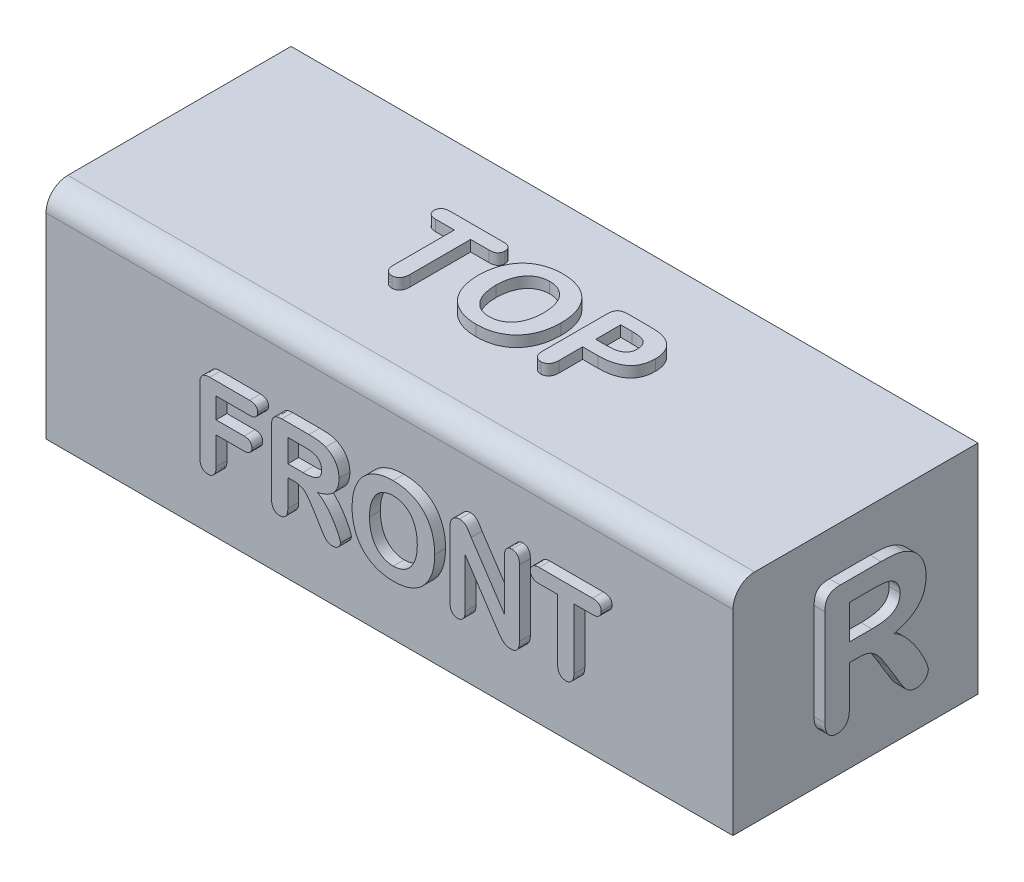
from build123d import *

# Parameters (mm, degrees)
SKETCH2_W           = 315.788918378
SKETCH2_H           = 112.648023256
BOSS_EXTRUDE1_DEPTH = 100
BOSS_EXTRUDE2_DEPTH = 5
BOSS_EXTRUDE3_DEPTH = 5
BOSS_EXTRUDE4_DEPTH = 5
BOSS_EXTRUDE5_DEPTH = 5
BOSS_EXTRUDE6_DEPTH = 5
BOSS_EXTRUDE7_DEPTH = 5
FILLET1_R           = 10


with BuildPart() as part:
    # Sketch2 → Boss-Extrude1 (new body)
    with BuildSketch(Plane(origin=(0, 0, 0), x_dir=(1, 0, 0), z_dir=(0, 1, 0))):
        Rectangle(SKETCH2_W, SKETCH2_H)
    extrude(amount=BOSS_EXTRUDE1_DEPTH)

    # Sketch3 → Boss-Extrude2 (add)
    # profile 1 of 3: a face of its own
    with BuildSketch(Plane(origin=(0, 100, 0), x_dir=(1, 0, 0), z_dir=(0, 1, 0))):
        with BuildLine():
            Line((-26.214904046, 15.737307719), (-34.753966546, 15.737307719))
            Line((-34.753966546, 15.737307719), (-34.753966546, -12.043942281))
            add(Edge.make_bspline(
                [(-34.753966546, -12.043942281), (-34.763223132, -12.420013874), (-34.780535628, -13.123376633), (-34.97752573, -14.10566757), (-35.296577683, -14.940231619), (-35.76121801, -15.61400255), (-36.324445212, -16.132848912), (-36.974837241, -16.499084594), (-37.702385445, -16.72849225), (-38.215760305, -16.751055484), (-38.480529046, -16.762692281)],
                knots=[0, 0, 0, 0, 1.324771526, 2.4777063, 3.516495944, 4.454151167, 5.338361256, 6.19400724, 7.068574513, 8, 8, 8, 8], degree=3))
            add(Edge.make_bspline(
                [(-38.480529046, -16.762692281), (-38.748253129, -16.752069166), (-39.268186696, -16.731438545), (-40.001146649, -16.486783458), (-40.669394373, -16.129202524), (-41.237490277, -15.597106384), (-41.710836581, -14.924402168), (-42.019404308, -14.08491765), (-42.22982937, -13.11426958), (-42.24559702, -12.415076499), (-42.253966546, -12.043942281)],
                knots=[0, 0, 0, 0, 0.936591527, 1.818907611, 2.686883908, 3.580272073, 4.52668274, 5.549195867, 6.699104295, 8, 8, 8, 8], degree=3))
            Line((-42.253966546, -12.043942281), (-42.253966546, 15.737307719))
            Line((-42.253966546, 15.737307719), (-50.800841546, 15.737307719))
            add(Edge.make_bspline(
                [(-50.800841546, 15.737307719), (-51.114438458, 15.745089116), (-51.70281048, 15.759688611), (-52.519432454, 15.936569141), (-53.220264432, 16.202250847), (-53.787337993, 16.601914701), (-54.221268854, 17.093413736), (-54.538206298, 17.65665405), (-54.718568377, 18.294185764), (-54.741934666, 18.741400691), (-54.753966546, 18.971682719)],
                knots=[0, 0, 0, 0, 1.298175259, 2.435642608, 3.448405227, 4.386245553, 5.281324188, 6.14672195, 7.045701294, 8, 8, 8, 8], degree=3))
            add(Edge.make_bspline(
                [(-54.753966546, 18.971682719), (-54.743949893, 19.212874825), (-54.724634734, 19.677966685), (-54.520600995, 20.32974135), (-54.203059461, 20.906127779), (-53.74645345, 21.386727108), (-53.172862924, 21.777235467), (-52.478528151, 22.046172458), (-51.675746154, 22.211335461), (-51.103818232, 22.228313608), (-50.800841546, 22.237307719)],
                knots=[0, 0, 0, 0, 0.993926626, 1.916593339, 2.793690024, 3.692250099, 4.629614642, 5.63892321, 6.749228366, 8, 8, 8, 8], degree=3))
            Line((-50.800841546, 22.237307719), (-26.214904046, 22.237307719))
            add(Edge.make_bspline(
                [(-26.214904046, 22.237307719), (-25.896170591, 22.229241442), (-25.297620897, 22.214093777), (-24.466417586, 22.040604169), (-23.756371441, 21.766803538), (-23.192376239, 21.353925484), (-22.743398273, 20.867855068), (-22.435330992, 20.294135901), (-22.238675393, 19.656303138), (-22.217853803, 19.20496846), (-22.207091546, 18.971682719)],
                knots=[0, 0, 0, 0, 1.304496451, 2.449714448, 3.464685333, 4.39788137, 5.28974218, 6.154486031, 7.046091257, 8, 8, 8, 8], degree=3))
            add(Edge.make_bspline(
                [(-22.207091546, 18.971682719), (-22.2184171, 18.741228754), (-22.240447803, 18.292944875), (-22.431364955, 17.65586123), (-22.755800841, 17.092929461), (-23.197726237, 16.601585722), (-23.772511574, 16.2022786), (-24.483227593, 15.935387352), (-25.308053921, 15.761097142), (-25.90138443, 15.745532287), (-26.214904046, 15.737307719)],
                knots=[0, 0, 0, 0, 0.94771637, 1.843517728, 2.708217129, 3.604275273, 4.544436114, 5.560171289, 6.710778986, 8, 8, 8, 8], degree=3))
        make_face()
    # profile 2 of 3: a face of its own
    with BuildSketch(Plane(origin=(0, 100, 0), x_dir=(1, 0, 0), z_dir=(0, 1, 0))):
        with BuildLine():
            add(Edge.make_bspline(
                [(0.113220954, 23.237307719), (0.608281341, 23.230358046), (1.579000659, 23.216731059), (3.007809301, 23.093206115), (4.385826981, 22.909857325), (5.712120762, 22.645947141), (6.983400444, 22.301582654), (8.199908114, 21.878352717), (9.363211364, 21.377659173), (10.47467072, 20.809325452), (11.522076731, 20.165973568), (12.512098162, 19.462435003), (13.433521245, 18.688388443), (14.288493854, 17.850628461), (15.071561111, 16.946869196), (15.794107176, 15.982128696), (16.450566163, 14.950980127), (17.033867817, 13.853642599), (17.557924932, 12.706512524), (18.012841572, 11.506227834), (18.392533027, 10.257873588), (18.708354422, 8.959381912), (18.947715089, 7.612653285), (19.11631698, 6.214533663), (19.233040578, 4.770537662), (19.241660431, 3.789629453), (19.246033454, 3.291995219)],
                knots=[0, 0, 0, 0, 1.137132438, 2.22970057, 3.292424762, 4.329649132, 5.333981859, 6.315987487, 7.286185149, 8.241436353, 9.181332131, 10.107725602, 11.0292572, 11.943085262, 12.854854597, 13.773819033, 14.709898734, 15.660115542, 16.626635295, 17.605574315, 18.606712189, 19.622473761, 20.67399022, 21.747038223, 22.857027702, 24, 24, 24, 24], degree=3))
            add(Edge.make_bspline(
                [(19.246033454, 3.291995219), (19.23077232, 2.562274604), (19.200828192, 1.130477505), (18.973692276, -0.96564749), (18.588652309, -2.960976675), (18.064256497, -4.854700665), (17.375007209, -6.633709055), (16.536460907, -8.295665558), (15.540367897, -9.832548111), (14.397459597, -11.242967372), (13.112106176, -12.518933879), (11.675526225, -13.631282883), (10.096628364, -14.580675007), (8.389437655, -15.380366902), (6.543728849, -16.010431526), (4.563239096, -16.434027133), (2.460200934, -16.722331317), (1.01268825, -16.7489996), (0.269470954, -16.762692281)],
                knots=[0, 0, 0, 0, 1.119700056, 2.196982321, 3.230778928, 4.235358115, 5.208318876, 6.153781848, 7.087131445, 8.013361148, 8.934611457, 9.860297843, 10.794468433, 11.756326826, 12.748403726, 13.780058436, 14.860183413, 16, 16, 16, 16], degree=3))
            add(Edge.make_bspline(
                [(0.269470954, -16.762692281), (-0.468391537, -16.744927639), (-1.912891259, -16.710150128), (-4.018629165, -16.431469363), (-6.009660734, -15.983171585), (-7.874618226, -15.342189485), (-9.600474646, -14.525927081), (-11.194466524, -13.575801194), (-12.625668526, -12.453395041), (-13.91246419, -11.19074694), (-15.054750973, -9.785865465), (-16.025873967, -8.231787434), (-16.882325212, -6.562336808), (-17.559292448, -4.752750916), (-18.097892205, -2.842288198), (-18.477487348, -0.845189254), (-18.708932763, 1.22662618), (-18.738796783, 2.63253543), (-18.753966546, 3.346682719)],
                knots=[0, 0, 0, 0, 1.130091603, 2.212359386, 3.247930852, 4.252250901, 5.226719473, 6.16821431, 7.089197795, 8.00610207, 8.925165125, 9.855999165, 10.808795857, 11.79501972, 12.810514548, 13.846493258, 14.906102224, 16, 16, 16, 16], degree=3))
            add(Edge.make_bspline(
                [(-18.753966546, 3.346682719), (-18.740205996, 4.073965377), (-18.713147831, 5.504063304), (-18.463331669, 7.599300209), (-18.06890634, 9.605262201), (-17.506717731, 11.511850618), (-16.793910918, 13.305671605), (-15.928713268, 14.967162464), (-14.926996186, 16.491173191), (-13.782130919, 17.874803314), (-12.492299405, 19.109628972), (-11.064717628, 20.18954271), (-9.506412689, 21.118497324), (-7.81731298, 21.882577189), (-6.005103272, 22.495852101), (-4.070254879, 22.928842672), (-2.016405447, 23.191154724), (-0.60893309, 23.221657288), (0.113220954, 23.237307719)],
                knots=[0, 0, 0, 0, 1.125218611, 2.212582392, 3.260701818, 4.286054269, 5.284468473, 6.243521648, 7.180287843, 8.101949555, 9.017004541, 9.937572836, 10.866572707, 11.818894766, 12.801573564, 13.82236102, 14.882684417, 16, 16, 16, 16], degree=3))
        make_face()
        with BuildLine():
            add(Edge.make_bspline(
                [(11.246033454, 3.346682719), (11.230755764, 4.042857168), (11.201174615, 5.390812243), (10.939003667, 7.340728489), (10.514367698, 9.14937191), (10.008254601, 10.549807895), (9.522260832, 11.587877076), (9.125350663, 12.310376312), (8.698392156, 12.990574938), (8.213803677, 13.605811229), (7.711136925, 14.185434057), (7.16691043, 14.715775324), (6.580176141, 15.188938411), (5.757965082, 15.763241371), (4.650722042, 16.358320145), (3.221095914, 16.868240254), (1.697167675, 17.182473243), (0.648597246, 17.218773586), (0.113220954, 17.237307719)],
                knots=[0, 0, 0, 0, 1.663767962, 3.22144036, 4.693807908, 6.09809827, 6.772124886, 7.43249818, 8.068074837, 8.689496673, 9.30272399, 9.901527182, 10.503429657, 11.102750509, 12.297797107, 13.495176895, 14.721094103, 16, 16, 16, 16], degree=3))
            add(Edge.make_bspline(
                [(0.113220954, 17.237307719), (-0.270276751, 17.227768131), (-1.028223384, 17.208914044), (-2.140861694, 17.029858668), (-3.209655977, 16.749835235), (-4.229633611, 16.358177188), (-5.191710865, 15.858009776), (-6.091583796, 15.250772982), (-6.918401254, 14.538830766), (-7.676791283, 13.725066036), (-8.362221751, 12.801278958), (-8.970326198, 11.757887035), (-9.500166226, 10.594876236), (-9.95187518, 9.322623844), (-10.309132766, 7.947671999), (-10.563161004, 6.484436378), (-10.722741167, 4.941345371), (-10.743403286, 3.886142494), (-10.753966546, 3.346682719)],
                knots=[0, 0, 0, 0, 0.926902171, 1.831933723, 2.71800685, 3.595261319, 4.468550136, 5.334998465, 6.214894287, 7.1017058, 8.020008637, 8.99111482, 10.01694856, 11.106630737, 12.25237115, 13.448355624, 14.695502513, 16, 16, 16, 16], degree=3))
            add(Edge.make_bspline(
                [(-10.753966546, 3.346682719), (-10.743374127, 2.80202438), (-10.722650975, 1.736447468), (-10.563396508, 0.177697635), (-10.307710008, -1.303301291), (-9.953003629, -2.700419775), (-9.494114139, -3.997369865), (-8.943242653, -5.182267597), (-8.325691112, -6.263564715), (-7.5971611, -7.211111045), (-6.810226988, -8.0472745), (-5.964505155, -8.775567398), (-5.066098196, -9.395996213), (-4.10640296, -9.901084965), (-3.090680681, -10.280059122), (-2.030159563, -10.567272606), (-0.917954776, -10.731320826), (-0.160732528, -10.752148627), (0.222595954, -10.762692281)],
                knots=[0, 0, 0, 0, 1.300369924, 2.54406124, 3.737115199, 4.88637188, 5.981883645, 7.016846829, 8.003376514, 8.948590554, 9.863559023, 10.741055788, 11.608647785, 12.46534091, 13.323432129, 14.192248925, 15.0848625, 16, 16, 16, 16], degree=3))
            add(Edge.make_bspline(
                [(0.222595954, -10.762692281), (0.716314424, -10.746156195), (1.689107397, -10.713574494), (3.11353355, -10.409361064), (4.474475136, -9.931055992), (5.552045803, -9.380329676), (6.364184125, -8.837830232), (6.951064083, -8.380147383), (7.496656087, -7.859326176), (8.016704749, -7.295471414), (8.498597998, -6.676288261), (8.954852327, -6.009629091), (9.376100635, -5.288366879), (9.765828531, -4.516534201), (10.117779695, -3.695535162), (10.42476253, -2.827550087), (10.669482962, -1.908763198), (10.883068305, -0.947707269), (11.04555294, 0.061939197), (11.161095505, 1.115340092), (11.233490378, 2.215458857), (11.241787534, 2.96375546), (11.246033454, 3.346682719)],
                knots=[0, 0, 0, 0, 1.468568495, 2.893578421, 4.316075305, 5.755382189, 6.482330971, 7.222315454, 7.968369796, 8.725783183, 9.504530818, 10.302500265, 11.129737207, 11.9897977, 12.875655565, 13.787998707, 14.728608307, 15.705132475, 16.718642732, 17.771954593, 18.859838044, 20, 20, 20, 20], degree=3))
        make_face(mode=Mode.SUBTRACT)
    # profile 3 of 3: a face of its own
    with BuildSketch(Plane(origin=(0, 100, 0), x_dir=(1, 0, 0), z_dir=(0, 1, 0))):
        with BuildLine():
            Line((40.808533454, -1.262692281), (33.746033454, -1.262692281))
            Line((33.746033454, -1.262692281), (33.746033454, -12.051754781))
            add(Edge.make_bspline(
                [(33.746033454, -12.051754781), (33.73703592, -12.414923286), (33.719977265, -13.103463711), (33.51431479, -14.06391779), (33.190497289, -14.896735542), (32.715133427, -15.572806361), (32.146018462, -16.105408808), (31.500459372, -16.492838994), (30.776029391, -16.71731249), (30.271008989, -16.747294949), (30.011658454, -16.762692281)],
                knots=[0, 0, 0, 0, 1.285699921, 2.437591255, 3.464765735, 4.43309728, 5.341309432, 6.21076238, 7.081146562, 8, 8, 8, 8], degree=3))
            add(Edge.make_bspline(
                [(30.011658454, -16.762692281), (29.742035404, -16.747273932), (29.219361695, -16.717384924), (28.472286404, -16.496849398), (27.819287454, -16.106744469), (27.244803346, -15.585811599), (26.785645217, -14.907070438), (26.470697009, -14.081469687), (26.27412657, -13.126043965), (26.255741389, -12.443440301), (26.246033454, -12.083004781)],
                knots=[0, 0, 0, 0, 0.952842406, 1.847118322, 2.721986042, 3.621319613, 4.568808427, 5.589565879, 6.727217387, 8, 8, 8, 8], degree=3))
            Line((26.246033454, -12.083004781), (26.246033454, 17.479495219))
            add(Edge.make_bspline(
                [(26.246033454, 17.479495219), (26.248206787, 17.685349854), (26.252396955, 18.08223592), (26.307669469, 18.6569603), (26.400334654, 19.184346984), (26.524447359, 19.669187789), (26.68643147, 20.104244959), (26.884567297, 20.495487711), (27.117928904, 20.842290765), (27.4913507, 21.244532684), (28.073344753, 21.66564703), (28.93186711, 22.002996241), (29.953046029, 22.203057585), (30.687719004, 22.22534662), (31.081970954, 22.237307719)],
                knots=[0, 0, 0, 0, 0.941718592, 1.815625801, 2.638480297, 3.389986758, 4.102699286, 4.758224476, 5.39283612, 6.008479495, 7.262224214, 8.640906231, 10.197389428, 12, 12, 12, 12], degree=3))
            Line((31.081970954, 22.237307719), (40.878845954, 22.237307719))
            add(Edge.make_bspline(
                [(40.878845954, 22.237307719), (41.230460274, 22.237374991), (41.913099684, 22.237505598), (42.90535539, 22.193749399), (43.835151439, 22.139557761), (44.703733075, 22.074653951), (45.508909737, 21.972265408), (46.250735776, 21.845416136), (46.93321326, 21.710914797), (47.361239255, 21.591436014), (47.566345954, 21.534182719)],
                knots=[0, 0, 0, 0, 1.25088383, 2.428520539, 3.533027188, 4.564878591, 5.52680176, 6.419426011, 7.242601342, 8, 8, 8, 8], degree=3))
            add(Edge.make_bspline(
                [(47.566345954, 21.534182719), (47.955189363, 21.415813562), (48.720132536, 21.182954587), (49.795238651, 20.678763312), (50.799781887, 20.086225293), (51.710910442, 19.372204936), (52.532634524, 18.56889827), (53.252438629, 17.67552844), (53.864723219, 16.694954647), (54.359983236, 15.6266418), (54.764690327, 14.490700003), (55.039848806, 13.279036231), (55.218925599, 12.000485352), (55.236861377, 11.123357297), (55.246033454, 10.674807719)],
                knots=[0, 0, 0, 0, 1.016072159, 1.998844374, 2.963446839, 3.929479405, 4.88809646, 5.833686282, 6.79396355, 7.773575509, 8.775354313, 9.806098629, 10.878073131, 12, 12, 12, 12], degree=3))
            add(Edge.make_bspline(
                [(55.246033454, 10.674807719), (55.236966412, 10.200250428), (55.219316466, 9.276475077), (55.041171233, 7.935350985), (54.76687255, 6.679353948), (54.365891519, 5.512620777), (53.849708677, 4.437121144), (53.218719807, 3.451756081), (52.478844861, 2.552279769), (51.622391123, 1.745015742), (50.653390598, 1.031599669), (49.57579882, 0.40832082), (48.378240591, -0.100020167), (47.078970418, -0.534635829), (45.664369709, -0.853926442), (44.146451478, -1.098852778), (42.514231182, -1.237293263), (41.389516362, -1.254041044), (40.808533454, -1.262692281)],
                knots=[0, 0, 0, 0, 1.064269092, 2.071710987, 3.030014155, 3.944730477, 4.833317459, 5.700512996, 6.563900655, 7.440202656, 8.334248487, 9.258341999, 10.226640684, 11.248485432, 12.328534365, 13.476518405, 14.696469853, 16, 16, 16, 16], degree=3))
        make_face()
        with BuildLine():
            Line((38.941345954, 16.237307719), (33.746033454, 16.237307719))
            Line((33.746033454, 16.237307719), (33.746033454, 4.737307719))
            Line((33.746033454, 4.737307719), (38.941345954, 4.737307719))
            add(Edge.make_bspline(
                [(38.941345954, 4.737307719), (39.376385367, 4.745816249), (40.211250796, 4.762144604), (41.410690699, 4.857408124), (42.496235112, 5.039015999), (43.476327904, 5.273134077), (44.347248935, 5.598620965), (45.106093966, 6.026110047), (45.764515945, 6.532917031), (46.305398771, 7.140072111), (46.740084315, 7.839291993), (47.02801656, 8.646688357), (47.214173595, 9.546576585), (47.235070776, 10.17898386), (47.246033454, 10.510745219)],
                knots=[0, 0, 0, 0, 1.355309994, 2.600917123, 3.743816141, 4.780660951, 5.735811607, 6.62931006, 7.484500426, 8.311764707, 9.149305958, 10.032284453, 10.967734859, 12, 12, 12, 12], degree=3))
            add(Edge.make_bspline(
                [(47.246033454, 10.510745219), (47.229212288, 10.908492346), (47.196791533, 11.675101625), (46.913875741, 12.766349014), (46.459841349, 13.754482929), (45.999029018, 14.295780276), (45.769470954, 14.565432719)],
                knots=[0, 0, 0, 0, 1.078100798, 2.07790835, 3.042491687, 4, 4, 4, 4], degree=3))
            add(Edge.make_bspline(
                [(45.769470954, 14.565432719), (45.61714711, 14.700754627), (45.29691554, 14.985242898), (44.706949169, 15.328626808), (44.003925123, 15.597999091), (43.205242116, 15.847657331), (42.292173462, 16.016538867), (41.272903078, 16.150939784), (40.142995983, 16.226583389), (39.352907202, 16.233634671), (38.941345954, 16.237307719)],
                knots=[0, 0, 0, 0, 0.67948794, 1.428492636, 2.263733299, 3.191206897, 4.220047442, 5.360670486, 6.625159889, 8, 8, 8, 8], degree=3))
        make_face(mode=Mode.SUBTRACT)
    extrude(amount=BOSS_EXTRUDE2_DEPTH)

    # Sketch4 → Boss-Extrude3 (add)
    # profile 1 of 6: a face of its own
    with BuildSketch(Plane.XZ):
        with BuildLine():
            Line((-95.041017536, -14.695203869), (-106.775392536, -14.695203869))
            add(Edge.make_bspline(
                [(-106.775392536, -14.695203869), (-106.981250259, -14.693101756), (-107.375549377, -14.689075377), (-107.945106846, -14.633676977), (-108.46712617, -14.540235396), (-108.945950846, -14.416655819), (-109.381403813, -14.260000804), (-109.773664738, -14.069275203), (-110.112692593, -13.827902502), (-110.519146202, -13.470940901), (-110.929488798, -12.889473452), (-111.258308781, -12.039589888), (-111.459992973, -11.029980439), (-111.482237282, -10.303024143), (-111.494142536, -9.913953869)],
                knots=[0, 0, 0, 0, 0.950729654, 1.821024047, 2.639907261, 3.398604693, 4.102683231, 4.775219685, 5.406000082, 6.019447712, 7.268382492, 8.644570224, 10.204158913, 12, 12, 12, 12], degree=3))
            Line((-111.494142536, -9.913953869), (-111.494142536, 19.023546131))
            add(Edge.make_bspline(
                [(-111.494142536, 19.023546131), (-111.483311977, 19.420603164), (-111.463176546, 20.158784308), (-111.251156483, 21.178410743), (-110.91618012, 22.030764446), (-110.412491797, 22.717311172), (-109.733694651, 23.22344115), (-108.889559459, 23.563666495), (-107.886994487, 23.771904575), (-107.161946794, 23.79335825), (-106.775392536, 23.804796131)],
                knots=[0, 0, 0, 0, 1.222174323, 2.272182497, 3.193385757, 4.024939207, 4.86132091, 5.767718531, 6.809874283, 8, 8, 8, 8], degree=3))
            Line((-106.775392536, 23.804796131), (-94.337892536, 23.804796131))
            add(Edge.make_bspline(
                [(-94.337892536, 23.804796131), (-93.895126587, 23.799777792), (-93.037784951, 23.790060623), (-91.799437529, 23.730583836), (-90.652408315, 23.621067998), (-89.588853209, 23.469855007), (-88.596132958, 23.24936903), (-87.657307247, 22.966115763), (-86.778903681, 22.578547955), (-86.228616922, 22.265228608), (-85.955080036, 22.109483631)],
                knots=[0, 0, 0, 0, 1.226361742, 2.374642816, 3.432537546, 4.416889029, 5.347867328, 6.246718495, 7.128477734, 8, 8, 8, 8], degree=3))
            add(Edge.make_bspline(
                [(-85.955080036, 22.109483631), (-85.728550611, 21.9674393), (-85.27551327, 21.683364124), (-84.642292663, 21.18910275), (-84.053954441, 20.635472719), (-83.502366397, 20.040172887), (-83.000768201, 19.398995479), (-82.561664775, 18.720242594), (-82.195691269, 18.00249557), (-81.881246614, 17.259676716), (-81.628498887, 16.48993282), (-81.461797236, 15.692979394), (-81.343095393, 14.878677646), (-81.334447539, 14.326071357), (-81.330080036, 14.046983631)],
                knots=[0, 0, 0, 0, 0.989179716, 1.978265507, 2.967116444, 3.97665542, 4.979268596, 5.976539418, 6.963744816, 7.957282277, 8.960127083, 9.956465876, 10.967935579, 12, 12, 12, 12], degree=3))
            add(Edge.make_bspline(
                [(-81.330080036, 14.046983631), (-81.347400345, 13.576769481), (-81.381102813, 12.661810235), (-81.66351662, 11.339954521), (-82.116401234, 10.111267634), (-82.766494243, 8.983878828), (-83.597826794, 7.953768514), (-84.623056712, 7.038613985), (-85.819042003, 6.209172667), (-86.711792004, 5.762520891), (-87.173830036, 5.531358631)],
                knots=[0, 0, 0, 0, 1.026786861, 1.997958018, 2.939919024, 3.878158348, 4.829291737, 5.820536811, 6.872030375, 8, 8, 8, 8], degree=3))
            add(Edge.make_bspline(
                [(-87.173830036, 5.531358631), (-86.86263255, 5.428169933), (-86.255295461, 5.22678552), (-85.385544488, 4.871061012), (-84.57069923, 4.492283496), (-83.81752336, 4.070507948), (-83.129232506, 3.605629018), (-82.491540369, 3.116306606), (-81.921256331, 2.583008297), (-81.408251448, 2.016373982), (-80.955546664, 1.415318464), (-80.559630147, 0.77882247), (-80.235692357, 0.103045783), (-79.953703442, -0.601201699), (-79.75965463, -1.351217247), (-79.595973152, -2.129209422), (-79.514401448, -2.946083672), (-79.500969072, -3.499756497), (-79.494142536, -3.781141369)],
                knots=[0, 0, 0, 0, 1.203679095, 2.349115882, 3.448557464, 4.501905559, 5.515114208, 6.496455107, 7.450530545, 8.378166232, 9.30006595, 10.210385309, 11.125664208, 12.049149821, 12.991069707, 13.966334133, 14.966460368, 16, 16, 16, 16], degree=3))
            add(Edge.make_bspline(
                [(-79.494142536, -3.781141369), (-79.511655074, -4.301162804), (-79.546236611, -5.328035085), (-79.881547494, -6.822154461), (-80.406011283, -8.240358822), (-81.143671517, -9.554488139), (-82.04636805, -10.75279281), (-83.11152721, -11.794135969), (-84.327588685, -12.671238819), (-85.231339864, -13.101899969), (-85.689455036, -13.320203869)],
                knots=[0, 0, 0, 0, 1.034007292, 2.041826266, 3.032819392, 4.03550363, 5.031030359, 6.010000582, 6.991261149, 8, 8, 8, 8], degree=3))
            add(Edge.make_bspline(
                [(-85.689455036, -13.320203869), (-85.992505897, -13.441877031), (-86.611403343, -13.690360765), (-87.59129421, -13.985165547), (-88.637100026, -14.215259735), (-89.749874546, -14.405897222), (-90.942700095, -14.532975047), (-92.224820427, -14.624148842), (-93.600214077, -14.691251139), (-94.551347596, -14.693860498), (-95.041017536, -14.695203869)],
                knots=[0, 0, 0, 0, 0.823393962, 1.68155411, 2.577109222, 3.523060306, 4.5276929, 5.601251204, 6.765057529, 8, 8, 8, 8], degree=3))
        make_face()
        with BuildLine():
            Line((-95.767580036, 2.304796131), (-103.994142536, 2.304796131))
            Line((-103.994142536, 2.304796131), (-103.994142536, -8.695203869))
            Line((-103.994142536, -8.695203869), (-95.501955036, -8.695203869))
            add(Edge.make_bspline(
                [(-95.501955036, -8.695203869), (-95.17894346, -8.690270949), (-94.553130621, -8.680713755), (-93.645267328, -8.6197037), (-92.799389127, -8.512692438), (-92.014527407, -8.354662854), (-91.290634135, -8.162375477), (-90.624999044, -7.931563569), (-90.031033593, -7.639317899), (-89.495923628, -7.311491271), (-89.020067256, -6.943187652), (-88.613219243, -6.525757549), (-88.260414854, -6.067427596), (-87.984651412, -5.558550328), (-87.758601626, -5.009783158), (-87.607317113, -4.415366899), (-87.510704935, -3.779093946), (-87.499754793, -3.341406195), (-87.494142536, -3.117078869)],
                knots=[0, 0, 0, 0, 1.397840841, 2.708221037, 3.935522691, 5.08480215, 6.170083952, 7.175292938, 8.127891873, 9.028615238, 9.887548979, 10.724312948, 11.544753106, 12.382123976, 13.221312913, 14.106963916, 15.029765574, 16, 16, 16, 16], degree=3))
            add(Edge.make_bspline(
                [(-87.494142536, -3.117078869), (-87.498835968, -2.887434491), (-87.507952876, -2.441354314), (-87.615378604, -1.800784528), (-87.768408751, -1.203430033), (-87.993892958, -0.6545972), (-88.29326816, -0.157773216), (-88.661285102, 0.28428974), (-89.081632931, 0.686954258), (-89.576459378, 1.029337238), (-90.125830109, 1.339548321), (-90.749202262, 1.589528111), (-91.427699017, 1.82080639), (-92.174211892, 1.995603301), (-92.980287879, 2.135323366), (-93.851187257, 2.238341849), (-94.78784167, 2.28780299), (-95.43420369, 2.299013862), (-95.767580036, 2.304796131)],
                knots=[0, 0, 0, 0, 0.978374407, 1.900475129, 2.762565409, 3.604092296, 4.421226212, 5.226116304, 6.051062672, 6.895443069, 7.785413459, 8.736294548, 9.754820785, 10.840413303, 12.001711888, 13.242950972, 14.577987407, 16, 16, 16, 16], degree=3))
        make_face(mode=Mode.SUBTRACT)
        with BuildLine():
            Line((-103.994142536, 17.804796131), (-103.994142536, 7.804796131))
            Line((-103.994142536, 7.804796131), (-96.751955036, 7.804796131))
            add(Edge.make_bspline(
                [(-96.751955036, 7.804796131), (-96.288143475, 7.808443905), (-95.413720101, 7.815321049), (-94.187029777, 7.926588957), (-93.1249403, 8.091813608), (-92.209852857, 8.325296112), (-91.426844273, 8.678152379), (-90.746172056, 9.143564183), (-90.174862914, 9.751919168), (-89.879534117, 10.226289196), (-89.728517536, 10.468858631)],
                knots=[0, 0, 0, 0, 1.403565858, 2.64614101, 3.724413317, 4.655733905, 5.495397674, 6.311071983, 7.136365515, 8, 8, 8, 8], degree=3))
            add(Edge.make_bspline(
                [(-89.728517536, 10.468858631), (-89.62314791, 10.656080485), (-89.41209797, 11.031076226), (-89.210986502, 11.646462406), (-89.064934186, 12.287516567), (-89.054269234, 12.728386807), (-89.048830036, 12.953233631)],
                knots=[0, 0, 0, 0, 0.986348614, 1.975605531, 2.967545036, 4, 4, 4, 4], degree=3))
            add(Edge.make_bspline(
                [(-89.048830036, 12.953233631), (-89.053343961, 13.188065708), (-89.061968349, 13.636740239), (-89.167978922, 14.278682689), (-89.329012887, 14.859526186), (-89.554468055, 15.384381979), (-89.857920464, 15.844742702), (-90.224639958, 16.246831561), (-90.665479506, 16.577502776), (-91.165839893, 16.854040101), (-91.733621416, 17.075143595), (-92.366053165, 17.270327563), (-93.064230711, 17.4433382), (-93.835733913, 17.569213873), (-94.671203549, 17.684262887), (-95.576827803, 17.745811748), (-96.550837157, 17.797744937), (-97.223221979, 17.802386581), (-97.572267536, 17.804796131)],
                knots=[0, 0, 0, 0, 1.003025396, 1.916398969, 2.77282862, 3.575462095, 4.347472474, 5.119643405, 5.89012688, 6.692528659, 7.556738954, 8.489916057, 9.521455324, 10.628856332, 11.830320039, 13.125714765, 14.507913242, 16, 16, 16, 16], degree=3))
            Line((-97.572267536, 17.804796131), (-103.994142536, 17.804796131))
        make_face(mode=Mode.SUBTRACT)
    # profile 2 of 6: a face of its own
    with BuildSketch(Plane.XZ):
        with BuildLine():
            add(Edge.make_bspline(
                [(-55.626955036, 24.804796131), (-55.13189465, 24.797846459), (-54.161175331, 24.784219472), (-52.73236669, 24.660694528), (-51.354349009, 24.477345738), (-50.028055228, 24.213435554), (-48.756775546, 23.869071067), (-47.540267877, 23.445841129), (-46.376964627, 22.945147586), (-45.26550527, 22.376813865), (-44.218099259, 21.73346198), (-43.228077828, 21.029923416), (-42.306654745, 20.255876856), (-41.451682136, 19.418116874), (-40.668614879, 18.514357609), (-39.946068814, 17.549617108), (-39.289609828, 16.51846854), (-38.706308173, 15.421131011), (-38.182251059, 14.274000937), (-37.727334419, 13.073716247), (-37.347642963, 11.825362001), (-37.031821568, 10.526870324), (-36.792460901, 9.180141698), (-36.623859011, 7.782022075), (-36.507135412, 6.338026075), (-36.498515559, 5.357117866), (-36.494142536, 4.859483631)],
                knots=[0, 0, 0, 0, 1.137132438, 2.22970057, 3.292424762, 4.329649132, 5.333981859, 6.315987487, 7.286185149, 8.241436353, 9.181332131, 10.107725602, 11.0292572, 11.943085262, 12.854854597, 13.773819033, 14.709898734, 15.660115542, 16.626635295, 17.605574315, 18.606712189, 19.622473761, 20.67399022, 21.747038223, 22.857027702, 24, 24, 24, 24], degree=3))
            add(Edge.make_bspline(
                [(-36.494142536, 4.859483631), (-36.50940367, 4.129763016), (-36.539347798, 2.697965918), (-36.766483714, 0.601840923), (-37.151523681, -1.393488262), (-37.675919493, -3.287212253), (-38.365168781, -5.066220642), (-39.203715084, -6.728177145), (-40.199808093, -8.265059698), (-41.342716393, -9.67547896), (-42.628069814, -10.951445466), (-44.064649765, -12.06379447), (-45.643547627, -13.013186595), (-47.350738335, -13.812878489), (-49.196447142, -14.442943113), (-51.176936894, -14.86653872), (-53.279975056, -15.154842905), (-54.72748774, -15.181511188), (-55.470705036, -15.195203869)],
                knots=[0, 0, 0, 0, 1.119700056, 2.196982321, 3.230778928, 4.235358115, 5.208318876, 6.153781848, 7.087131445, 8.013361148, 8.934611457, 9.860297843, 10.794468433, 11.756326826, 12.748403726, 13.780058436, 14.860183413, 16, 16, 16, 16], degree=3))
            add(Edge.make_bspline(
                [(-55.470705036, -15.195203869), (-56.208567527, -15.177439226), (-57.653067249, -15.142661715), (-59.758805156, -14.863980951), (-61.749836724, -14.415683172), (-63.614794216, -13.774701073), (-65.340650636, -12.958438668), (-66.934642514, -12.008312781), (-68.365844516, -10.885906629), (-69.65264018, -9.623258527), (-70.794926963, -8.218377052), (-71.766049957, -6.664299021), (-72.622501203, -4.994848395), (-73.299468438, -3.185262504), (-73.838068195, -1.274799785), (-74.217663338, 0.722299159), (-74.449108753, 2.794114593), (-74.478972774, 4.200023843), (-74.494142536, 4.914171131)],
                knots=[0, 0, 0, 0, 1.130091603, 2.212359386, 3.247930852, 4.252250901, 5.226719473, 6.16821431, 7.089197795, 8.00610207, 8.925165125, 9.855999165, 10.808795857, 11.79501972, 12.810514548, 13.846493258, 14.906102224, 16, 16, 16, 16], degree=3))
            add(Edge.make_bspline(
                [(-74.494142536, 4.914171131), (-74.480381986, 5.641453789), (-74.453323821, 7.071551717), (-74.203507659, 9.166788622), (-73.80908233, 11.172750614), (-73.246893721, 13.079339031), (-72.534086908, 14.873160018), (-71.668889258, 16.534650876), (-70.667172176, 18.058661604), (-69.52230691, 19.442291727), (-68.232475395, 20.677117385), (-66.804893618, 21.757031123), (-65.246588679, 22.685985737), (-63.557488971, 23.450065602), (-61.745279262, 24.063340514), (-59.81043087, 24.496331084), (-57.756581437, 24.758643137), (-56.34910908, 24.7891457), (-55.626955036, 24.804796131)],
                knots=[0, 0, 0, 0, 1.125218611, 2.212582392, 3.260701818, 4.286054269, 5.284468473, 6.243521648, 7.180287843, 8.101949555, 9.017004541, 9.937572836, 10.866572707, 11.818894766, 12.801573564, 13.82236102, 14.882684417, 16, 16, 16, 16], degree=3))
        make_face()
        with BuildLine():
            add(Edge.make_bspline(
                [(-44.494142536, 4.914171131), (-44.509420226, 5.610345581), (-44.539001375, 6.958300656), (-44.801172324, 8.908216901), (-45.225808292, 10.716860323), (-45.731921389, 12.117296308), (-46.217915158, 13.155365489), (-46.614825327, 13.877864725), (-47.041783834, 14.55806335), (-47.526372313, 15.173299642), (-48.029039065, 15.752922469), (-48.57326556, 16.283263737), (-49.159999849, 16.756426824), (-49.982210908, 17.330729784), (-51.089453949, 17.925808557), (-52.519080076, 18.435728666), (-54.043008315, 18.749961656), (-55.091578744, 18.786261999), (-55.626955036, 18.804796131)],
                knots=[0, 0, 0, 0, 1.663767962, 3.22144036, 4.693807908, 6.09809827, 6.772124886, 7.43249818, 8.068074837, 8.689496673, 9.30272399, 9.901527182, 10.503429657, 11.102750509, 12.297797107, 13.495176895, 14.721094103, 16, 16, 16, 16], degree=3))
            add(Edge.make_bspline(
                [(-55.626955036, 18.804796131), (-56.010452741, 18.795256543), (-56.768399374, 18.776402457), (-57.881037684, 18.59734708), (-58.949831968, 18.317323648), (-59.969809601, 17.925665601), (-60.931886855, 17.425498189), (-61.831759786, 16.818261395), (-62.658577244, 16.106319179), (-63.416967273, 15.292554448), (-64.102397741, 14.368767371), (-64.710502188, 13.325375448), (-65.240342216, 12.162364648), (-65.69205117, 10.890112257), (-66.049308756, 9.515160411), (-66.303336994, 8.05192479), (-66.462917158, 6.508833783), (-66.483579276, 5.453630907), (-66.494142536, 4.914171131)],
                knots=[0, 0, 0, 0, 0.926902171, 1.831933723, 2.71800685, 3.595261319, 4.468550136, 5.334998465, 6.214894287, 7.1017058, 8.020008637, 8.99111482, 10.01694856, 11.106630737, 12.25237115, 13.448355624, 14.695502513, 16, 16, 16, 16], degree=3))
            add(Edge.make_bspline(
                [(-66.494142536, 4.914171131), (-66.483550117, 4.369512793), (-66.462826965, 3.30393588), (-66.303572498, 1.745186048), (-66.047885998, 0.264187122), (-65.693179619, -1.132931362), (-65.234290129, -2.429881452), (-64.683418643, -3.614779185), (-64.065867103, -4.696076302), (-63.33733709, -5.643622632), (-62.550402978, -6.479786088), (-61.704681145, -7.208078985), (-60.806274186, -7.8285078), (-59.84657895, -8.333596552), (-58.830856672, -8.712570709), (-57.770335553, -8.999784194), (-56.658130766, -9.163832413), (-55.900908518, -9.184660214), (-55.517580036, -9.195203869)],
                knots=[0, 0, 0, 0, 1.300369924, 2.54406124, 3.737115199, 4.88637188, 5.981883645, 7.016846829, 8.003376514, 8.948590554, 9.863559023, 10.741055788, 11.608647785, 12.46534091, 13.323432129, 14.192248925, 15.0848625, 16, 16, 16, 16], degree=3))
            add(Edge.make_bspline(
                [(-55.517580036, -9.195203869), (-55.023861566, -9.178667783), (-54.051068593, -9.146086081), (-52.62664244, -8.841872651), (-51.265700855, -8.36356758), (-50.188130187, -7.812841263), (-49.375991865, -7.27034182), (-48.789111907, -6.81265897), (-48.243519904, -6.291837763), (-47.723471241, -5.727983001), (-47.241577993, -5.108799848), (-46.785323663, -4.442140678), (-46.364075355, -3.720878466), (-45.974347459, -2.949045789), (-45.622396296, -2.128046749), (-45.315413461, -1.260061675), (-45.070693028, -0.341274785), (-44.857107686, 0.619781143), (-44.69462305, 1.62942761), (-44.579080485, 2.682828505), (-44.506685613, 3.78294727), (-44.498388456, 4.531243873), (-44.494142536, 4.914171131)],
                knots=[0, 0, 0, 0, 1.468568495, 2.893578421, 4.316075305, 5.755382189, 6.482330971, 7.222315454, 7.968369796, 8.725783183, 9.504530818, 10.302500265, 11.129737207, 11.9897977, 12.875655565, 13.787998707, 14.728608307, 15.705132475, 16.718642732, 17.771954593, 18.859838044, 20, 20, 20, 20], degree=3))
        make_face(mode=Mode.SUBTRACT)
    # profile 3 of 6: a face of its own
    with BuildSketch(Plane.XZ):
        with BuildLine():
            Line((-4.955080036, 17.304796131), (-13.494142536, 17.304796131))
            Line((-13.494142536, 17.304796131), (-13.494142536, -10.476453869))
            add(Edge.make_bspline(
                [(-13.494142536, -10.476453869), (-13.503399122, -10.852525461), (-13.520711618, -11.55588822), (-13.71770172, -12.538179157), (-14.036753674, -13.372743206), (-14.501394, -14.046514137), (-15.064621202, -14.565360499), (-15.715013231, -14.931596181), (-16.442561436, -15.161003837), (-16.955936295, -15.183567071), (-17.220705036, -15.195203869)],
                knots=[0, 0, 0, 0, 1.324771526, 2.4777063, 3.516495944, 4.454151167, 5.338361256, 6.19400724, 7.068574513, 8, 8, 8, 8], degree=3))
            add(Edge.make_bspline(
                [(-17.220705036, -15.195203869), (-17.48842912, -15.184580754), (-18.008362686, -15.163950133), (-18.74132264, -14.919295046), (-19.409570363, -14.561714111), (-19.977666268, -14.029617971), (-20.451012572, -13.356913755), (-20.759580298, -12.517429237), (-20.97000536, -11.546781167), (-20.98577301, -10.847588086), (-20.994142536, -10.476453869)],
                knots=[0, 0, 0, 0, 0.936591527, 1.818907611, 2.686883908, 3.580272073, 4.52668274, 5.549195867, 6.699104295, 8, 8, 8, 8], degree=3))
            Line((-20.994142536, -10.476453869), (-20.994142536, 17.304796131))
            Line((-20.994142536, 17.304796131), (-29.541017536, 17.304796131))
            add(Edge.make_bspline(
                [(-29.541017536, 17.304796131), (-29.854614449, 17.312577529), (-30.44298647, 17.327177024), (-31.259608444, 17.504057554), (-31.960440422, 17.769739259), (-32.527513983, 18.169403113), (-32.961444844, 18.660902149), (-33.278382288, 19.224142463), (-33.458744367, 19.861674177), (-33.482110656, 20.308889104), (-33.494142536, 20.539171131)],
                knots=[0, 0, 0, 0, 1.298175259, 2.435642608, 3.448405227, 4.386245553, 5.281324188, 6.14672195, 7.045701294, 8, 8, 8, 8], degree=3))
            add(Edge.make_bspline(
                [(-33.494142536, 20.539171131), (-33.484125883, 20.780363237), (-33.464810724, 21.245455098), (-33.260776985, 21.897229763), (-32.943235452, 22.473616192), (-32.486629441, 22.95421552), (-31.913038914, 23.34472388), (-31.218704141, 23.61366087), (-30.415922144, 23.778823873), (-29.843994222, 23.795802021), (-29.541017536, 23.804796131)],
                knots=[0, 0, 0, 0, 0.993926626, 1.916593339, 2.793690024, 3.692250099, 4.629614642, 5.63892321, 6.749228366, 8, 8, 8, 8], degree=3))
            Line((-29.541017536, 23.804796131), (-4.955080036, 23.804796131))
            add(Edge.make_bspline(
                [(-4.955080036, 23.804796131), (-4.636346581, 23.796729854), (-4.037796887, 23.781582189), (-3.206593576, 23.608092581), (-2.496547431, 23.334291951), (-1.932552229, 22.921413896), (-1.483574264, 22.435343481), (-1.175506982, 21.861624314), (-0.978851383, 21.22379155), (-0.958029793, 20.772456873), (-0.947267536, 20.539171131)],
                knots=[0, 0, 0, 0, 1.304496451, 2.449714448, 3.464685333, 4.39788137, 5.28974218, 6.154486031, 7.046091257, 8, 8, 8, 8], degree=3))
            add(Edge.make_bspline(
                [(-0.947267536, 20.539171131), (-0.95859309, 20.308717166), (-0.980623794, 19.860433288), (-1.171540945, 19.223349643), (-1.495976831, 18.660417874), (-1.937902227, 18.169074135), (-2.512687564, 17.769767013), (-3.223403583, 17.502875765), (-4.048229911, 17.328585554), (-4.64156042, 17.3130207), (-4.955080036, 17.304796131)],
                knots=[0, 0, 0, 0, 0.94771637, 1.843517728, 2.708217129, 3.604275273, 4.544436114, 5.560171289, 6.710778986, 8, 8, 8, 8], degree=3))
        make_face()
    # profile 4 of 6: a face of its own
    with BuildSketch(Plane.XZ):
        with BuildLine():
            Line((29.044919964, 17.304796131), (20.505857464, 17.304796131))
            Line((20.505857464, 17.304796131), (20.505857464, -10.476453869))
            add(Edge.make_bspline(
                [(20.505857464, -10.476453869), (20.496600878, -10.852525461), (20.479288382, -11.55588822), (20.28229828, -12.538179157), (19.963246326, -13.372743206), (19.498606, -14.046514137), (18.935378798, -14.565360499), (18.284986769, -14.931596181), (17.557438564, -15.161003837), (17.044063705, -15.183567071), (16.779294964, -15.195203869)],
                knots=[0, 0, 0, 0, 1.324771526, 2.4777063, 3.516495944, 4.454151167, 5.338361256, 6.19400724, 7.068574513, 8, 8, 8, 8], degree=3))
            add(Edge.make_bspline(
                [(16.779294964, -15.195203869), (16.51157088, -15.184580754), (15.991637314, -15.163950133), (15.25867736, -14.919295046), (14.590429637, -14.561714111), (14.022333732, -14.029617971), (13.548987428, -13.356913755), (13.240419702, -12.517429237), (13.02999464, -11.546781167), (13.01422699, -10.847588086), (13.005857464, -10.476453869)],
                knots=[0, 0, 0, 0, 0.936591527, 1.818907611, 2.686883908, 3.580272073, 4.52668274, 5.549195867, 6.699104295, 8, 8, 8, 8], degree=3))
            Line((13.005857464, -10.476453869), (13.005857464, 17.304796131))
            Line((13.005857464, 17.304796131), (4.458982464, 17.304796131))
            add(Edge.make_bspline(
                [(4.458982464, 17.304796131), (4.145385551, 17.312577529), (3.55701353, 17.327177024), (2.740391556, 17.504057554), (2.039559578, 17.769739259), (1.472486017, 18.169403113), (1.038555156, 18.660902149), (0.721617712, 19.224142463), (0.541255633, 19.861674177), (0.517889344, 20.308889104), (0.505857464, 20.539171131)],
                knots=[0, 0, 0, 0, 1.298175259, 2.435642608, 3.448405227, 4.386245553, 5.281324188, 6.14672195, 7.045701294, 8, 8, 8, 8], degree=3))
            add(Edge.make_bspline(
                [(0.505857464, 20.539171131), (0.515874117, 20.780363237), (0.535189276, 21.245455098), (0.739223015, 21.897229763), (1.056764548, 22.473616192), (1.513370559, 22.95421552), (2.086961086, 23.34472388), (2.781295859, 23.61366087), (3.584077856, 23.778823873), (4.156005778, 23.795802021), (4.458982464, 23.804796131)],
                knots=[0, 0, 0, 0, 0.993926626, 1.916593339, 2.793690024, 3.692250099, 4.629614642, 5.63892321, 6.749228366, 8, 8, 8, 8], degree=3))
            Line((4.458982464, 23.804796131), (29.044919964, 23.804796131))
            add(Edge.make_bspline(
                [(29.044919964, 23.804796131), (29.363653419, 23.796729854), (29.962203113, 23.781582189), (30.793406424, 23.608092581), (31.503452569, 23.334291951), (32.067447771, 22.921413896), (32.516425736, 22.435343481), (32.824493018, 21.861624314), (33.021148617, 21.22379155), (33.041970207, 20.772456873), (33.052732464, 20.539171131)],
                knots=[0, 0, 0, 0, 1.304496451, 2.449714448, 3.464685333, 4.39788137, 5.28974218, 6.154486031, 7.046091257, 8, 8, 8, 8], degree=3))
            add(Edge.make_bspline(
                [(33.052732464, 20.539171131), (33.04140691, 20.308717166), (33.019376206, 19.860433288), (32.828459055, 19.223349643), (32.504023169, 18.660417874), (32.062097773, 18.169074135), (31.487312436, 17.769767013), (30.776596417, 17.502875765), (29.951770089, 17.328585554), (29.35843958, 17.3130207), (29.044919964, 17.304796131)],
                knots=[0, 0, 0, 0, 0.94771637, 1.843517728, 2.708217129, 3.604275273, 4.544436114, 5.560171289, 6.710778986, 8, 8, 8, 8], degree=3))
        make_face()
    # profile 5 of 6: a face of its own
    with BuildSketch(Plane.XZ):
        with BuildLine():
            add(Edge.make_bspline(
                [(55.373044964, 24.804796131), (55.86810535, 24.797846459), (56.838824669, 24.784219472), (58.26763331, 24.660694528), (59.645650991, 24.477345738), (60.971944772, 24.213435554), (62.243224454, 23.869071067), (63.459732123, 23.445841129), (64.623035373, 22.945147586), (65.73449473, 22.376813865), (66.781900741, 21.73346198), (67.771922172, 21.029923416), (68.693345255, 20.255876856), (69.548317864, 19.418116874), (70.331385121, 18.514357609), (71.053931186, 17.549617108), (71.710390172, 16.51846854), (72.293691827, 15.421131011), (72.817748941, 14.274000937), (73.272665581, 13.073716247), (73.652357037, 11.825362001), (73.968178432, 10.526870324), (74.207539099, 9.180141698), (74.376140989, 7.782022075), (74.492864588, 6.338026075), (74.501484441, 5.357117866), (74.505857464, 4.859483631)],
                knots=[0, 0, 0, 0, 1.137132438, 2.22970057, 3.292424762, 4.329649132, 5.333981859, 6.315987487, 7.286185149, 8.241436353, 9.181332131, 10.107725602, 11.0292572, 11.943085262, 12.854854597, 13.773819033, 14.709898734, 15.660115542, 16.626635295, 17.605574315, 18.606712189, 19.622473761, 20.67399022, 21.747038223, 22.857027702, 24, 24, 24, 24], degree=3))
            add(Edge.make_bspline(
                [(74.505857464, 4.859483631), (74.49059633, 4.129763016), (74.460652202, 2.697965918), (74.233516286, 0.601840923), (73.848476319, -1.393488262), (73.324080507, -3.287212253), (72.634831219, -5.066220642), (71.796284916, -6.728177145), (70.800191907, -8.265059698), (69.657283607, -9.67547896), (68.371930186, -10.951445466), (66.935350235, -12.06379447), (65.356452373, -13.013186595), (63.649261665, -13.812878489), (61.803552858, -14.442943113), (59.823063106, -14.86653872), (57.720024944, -15.154842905), (56.27251226, -15.181511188), (55.529294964, -15.195203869)],
                knots=[0, 0, 0, 0, 1.119700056, 2.196982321, 3.230778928, 4.235358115, 5.208318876, 6.153781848, 7.087131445, 8.013361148, 8.934611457, 9.860297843, 10.794468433, 11.756326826, 12.748403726, 13.780058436, 14.860183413, 16, 16, 16, 16], degree=3))
            add(Edge.make_bspline(
                [(55.529294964, -15.195203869), (54.791432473, -15.177439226), (53.346932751, -15.142661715), (51.241194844, -14.863980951), (49.250163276, -14.415683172), (47.385205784, -13.774701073), (45.659349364, -12.958438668), (44.065357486, -12.008312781), (42.634155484, -10.885906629), (41.34735982, -9.623258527), (40.205073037, -8.218377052), (39.233950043, -6.664299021), (38.377498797, -4.994848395), (37.700531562, -3.185262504), (37.161931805, -1.274799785), (36.782336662, 0.722299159), (36.550891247, 2.794114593), (36.521027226, 4.200023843), (36.505857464, 4.914171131)],
                knots=[0, 0, 0, 0, 1.130091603, 2.212359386, 3.247930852, 4.252250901, 5.226719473, 6.16821431, 7.089197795, 8.00610207, 8.925165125, 9.855999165, 10.808795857, 11.79501972, 12.810514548, 13.846493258, 14.906102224, 16, 16, 16, 16], degree=3))
            add(Edge.make_bspline(
                [(36.505857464, 4.914171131), (36.519618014, 5.641453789), (36.546676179, 7.071551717), (36.796492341, 9.166788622), (37.19091767, 11.172750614), (37.753106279, 13.079339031), (38.465913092, 14.873160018), (39.331110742, 16.534650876), (40.332827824, 18.058661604), (41.47769309, 19.442291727), (42.767524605, 20.677117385), (44.195106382, 21.757031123), (45.753411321, 22.685985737), (47.442511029, 23.450065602), (49.254720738, 24.063340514), (51.18956913, 24.496331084), (53.243418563, 24.758643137), (54.65089092, 24.7891457), (55.373044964, 24.804796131)],
                knots=[0, 0, 0, 0, 1.125218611, 2.212582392, 3.260701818, 4.286054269, 5.284468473, 6.243521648, 7.180287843, 8.101949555, 9.017004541, 9.937572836, 10.866572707, 11.818894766, 12.801573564, 13.82236102, 14.882684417, 16, 16, 16, 16], degree=3))
        make_face()
        with BuildLine():
            add(Edge.make_bspline(
                [(66.505857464, 4.914171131), (66.490579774, 5.610345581), (66.460998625, 6.958300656), (66.198827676, 8.908216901), (65.774191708, 10.716860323), (65.268078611, 12.117296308), (64.782084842, 13.155365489), (64.385174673, 13.877864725), (63.958216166, 14.55806335), (63.473627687, 15.173299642), (62.970960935, 15.752922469), (62.42673444, 16.283263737), (61.840000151, 16.756426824), (61.017789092, 17.330729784), (59.910546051, 17.925808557), (58.480919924, 18.435728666), (56.956991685, 18.749961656), (55.908421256, 18.786261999), (55.373044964, 18.804796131)],
                knots=[0, 0, 0, 0, 1.663767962, 3.22144036, 4.693807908, 6.09809827, 6.772124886, 7.43249818, 8.068074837, 8.689496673, 9.30272399, 9.901527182, 10.503429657, 11.102750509, 12.297797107, 13.495176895, 14.721094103, 16, 16, 16, 16], degree=3))
            add(Edge.make_bspline(
                [(55.373044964, 18.804796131), (54.989547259, 18.795256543), (54.231600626, 18.776402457), (53.118962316, 18.59734708), (52.050168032, 18.317323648), (51.030190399, 17.925665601), (50.068113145, 17.425498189), (49.168240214, 16.818261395), (48.341422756, 16.106319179), (47.583032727, 15.292554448), (46.897602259, 14.368767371), (46.289497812, 13.325375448), (45.759657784, 12.162364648), (45.30794883, 10.890112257), (44.950691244, 9.515160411), (44.696663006, 8.05192479), (44.537082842, 6.508833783), (44.516420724, 5.453630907), (44.505857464, 4.914171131)],
                knots=[0, 0, 0, 0, 0.926902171, 1.831933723, 2.71800685, 3.595261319, 4.468550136, 5.334998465, 6.214894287, 7.1017058, 8.020008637, 8.99111482, 10.01694856, 11.106630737, 12.25237115, 13.448355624, 14.695502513, 16, 16, 16, 16], degree=3))
            add(Edge.make_bspline(
                [(44.505857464, 4.914171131), (44.516449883, 4.369512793), (44.537173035, 3.30393588), (44.696427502, 1.745186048), (44.952114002, 0.264187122), (45.306820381, -1.132931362), (45.765709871, -2.429881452), (46.316581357, -3.614779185), (46.934132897, -4.696076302), (47.66266291, -5.643622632), (48.449597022, -6.479786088), (49.295318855, -7.208078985), (50.193725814, -7.8285078), (51.15342105, -8.333596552), (52.169143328, -8.712570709), (53.229664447, -8.999784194), (54.341869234, -9.163832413), (55.099091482, -9.184660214), (55.482419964, -9.195203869)],
                knots=[0, 0, 0, 0, 1.300369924, 2.54406124, 3.737115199, 4.88637188, 5.981883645, 7.016846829, 8.003376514, 8.948590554, 9.863559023, 10.741055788, 11.608647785, 12.46534091, 13.323432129, 14.192248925, 15.0848625, 16, 16, 16, 16], degree=3))
            add(Edge.make_bspline(
                [(55.482419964, -9.195203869), (55.976138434, -9.178667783), (56.948931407, -9.146086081), (58.37335756, -8.841872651), (59.734299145, -8.36356758), (60.811869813, -7.812841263), (61.624008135, -7.27034182), (62.210888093, -6.81265897), (62.756480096, -6.291837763), (63.276528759, -5.727983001), (63.758422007, -5.108799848), (64.214676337, -4.442140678), (64.635924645, -3.720878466), (65.025652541, -2.949045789), (65.377603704, -2.128046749), (65.684586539, -1.260061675), (65.929306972, -0.341274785), (66.142892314, 0.619781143), (66.30537695, 1.62942761), (66.420919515, 2.682828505), (66.493314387, 3.78294727), (66.501611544, 4.531243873), (66.505857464, 4.914171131)],
                knots=[0, 0, 0, 0, 1.468568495, 2.893578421, 4.316075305, 5.755382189, 6.482330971, 7.222315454, 7.968369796, 8.725783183, 9.504530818, 10.302500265, 11.129737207, 11.9897977, 12.875655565, 13.787998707, 14.728608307, 15.705132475, 16.718642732, 17.771954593, 18.859838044, 20, 20, 20, 20], degree=3))
        make_face(mode=Mode.SUBTRACT)
    # profile 6 of 6: a face of its own
    with BuildSketch(Plane.XZ):
        with BuildLine():
            Line((94.232419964, -8.734266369), (88.005857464, 15.804796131))
            Line((88.005857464, 15.804796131), (88.005857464, -10.781141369))
            add(Edge.make_bspline(
                [(88.005857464, -10.781141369), (87.99539477, -11.128538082), (87.975799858, -11.77915523), (87.792860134, -12.688232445), (87.507720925, -13.469495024), (87.072760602, -14.102902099), (86.544157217, -14.593225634), (85.932113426, -14.950702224), (85.234895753, -15.156569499), (84.744201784, -15.182027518), (84.490232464, -15.195203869)],
                knots=[0, 0, 0, 0, 1.30362474, 2.441475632, 3.469867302, 4.406120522, 5.299256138, 6.158467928, 7.046875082, 8, 8, 8, 8], degree=3))
            add(Edge.make_bspline(
                [(84.490232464, -15.195203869), (84.243897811, -15.182181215), (83.765686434, -15.156900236), (83.08543912, -14.945737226), (82.47604357, -14.602186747), (81.943639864, -14.118399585), (81.518186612, -13.486582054), (81.211487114, -12.715479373), (81.038365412, -11.804350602), (81.017144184, -11.151698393), (81.005857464, -10.804578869)],
                knots=[0, 0, 0, 0, 0.931401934, 1.808137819, 2.66942439, 3.563139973, 4.50699297, 5.529036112, 6.685793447, 8, 8, 8, 8], degree=3))
            Line((81.005857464, -10.804578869), (81.005857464, 19.539171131))
            add(Edge.make_bspline(
                [(81.005857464, 19.539171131), (81.011557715, 19.739772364), (81.022535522, 20.126099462), (81.07218908, 20.681147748), (81.173264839, 21.187108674), (81.320239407, 21.637215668), (81.504042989, 22.038077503), (81.718976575, 22.393945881), (81.98794022, 22.694240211), (82.408742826, 23.022257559), (83.023062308, 23.341123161), (83.856603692, 23.614695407), (84.801707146, 23.777165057), (85.46874004, 23.795294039), (85.818357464, 23.804796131)],
                knots=[0, 0, 0, 0, 0.969665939, 1.867427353, 2.689218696, 3.457225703, 4.149776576, 4.816702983, 5.458338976, 6.085245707, 7.385799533, 8.77853966, 10.311509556, 12, 12, 12, 12], degree=3))
            Line((85.818357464, 23.804796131), (88.216794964, 23.804796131))
            add(Edge.make_bspline(
                [(88.216794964, 23.804796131), (88.552804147, 23.800644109), (89.176212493, 23.792940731), (90.036634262, 23.730061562), (90.748282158, 23.6066625), (91.332173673, 23.441157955), (91.80989369, 23.193435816), (92.214969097, 22.879907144), (92.548745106, 22.477950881), (92.819659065, 21.984138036), (93.061393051, 21.37425537), (93.313683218, 20.623502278), (93.598104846, 19.719232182), (93.771888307, 19.058260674), (93.865232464, 18.703233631)],
                knots=[0, 0, 0, 0, 1.38803647, 2.575267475, 3.558583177, 4.368440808, 5.070869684, 5.768090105, 6.470518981, 7.212366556, 8.085347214, 9.177334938, 10.483864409, 12, 12, 12, 12], degree=3))
            Line((93.865232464, 18.703233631), (99.505857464, -2.195203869))
            Line((99.505857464, -2.195203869), (105.076169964, 18.703233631))
            add(Edge.make_bspline(
                [(105.076169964, 18.703233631), (105.169549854, 19.058240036), (105.34339984, 19.719173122), (105.627398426, 20.623687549), (105.880916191, 21.37373163), (106.119726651, 21.986787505), (106.401668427, 22.475764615), (106.733710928, 22.880241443), (107.139497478, 23.193237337), (107.619078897, 23.442811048), (108.209057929, 23.60611913), (108.92819593, 23.7301258), (109.793869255, 23.792687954), (110.419856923, 23.800567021), (110.755857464, 23.804796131)],
                knots=[0, 0, 0, 0, 1.511478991, 2.813995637, 3.902629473, 4.772928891, 5.517843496, 6.218114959, 6.913193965, 7.613465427, 8.431097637, 9.421953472, 10.616226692, 12, 12, 12, 12], degree=3))
            Line((110.755857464, 23.804796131), (113.162107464, 23.804796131))
            add(Edge.make_bspline(
                [(113.162107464, 23.804796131), (113.514291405, 23.795200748), (114.186425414, 23.776888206), (115.137206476, 23.61590713), (115.972639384, 23.34072454), (116.588370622, 23.023144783), (117.007806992, 22.691673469), (117.286308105, 22.397176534), (117.497030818, 22.035456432), (117.696436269, 21.641193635), (117.824823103, 21.18399136), (117.943566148, 20.682707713), (117.98802221, 20.125809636), (117.999761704, 19.739673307), (118.005857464, 19.539171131)],
                knots=[0, 0, 0, 0, 1.69575107, 3.236297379, 4.624693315, 5.921190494, 6.546141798, 7.194208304, 7.859054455, 8.55478081, 9.316580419, 10.138397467, 11.033358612, 12, 12, 12, 12], degree=3))
            Line((118.005857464, 19.539171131), (118.005857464, -10.804578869))
            add(Edge.make_bspline(
                [(118.005857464, -10.804578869), (117.995096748, -11.149294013), (117.974872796, -11.797160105), (117.794695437, -12.702071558), (117.505193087, -13.478627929), (117.075366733, -14.110760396), (116.540207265, -14.595223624), (115.924026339, -14.950836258), (115.219101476, -15.156520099), (114.723343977, -15.182012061), (114.466794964, -15.195203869)],
                knots=[0, 0, 0, 0, 1.293518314, 2.431070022, 3.450077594, 4.386084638, 5.272371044, 6.139835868, 7.037385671, 8, 8, 8, 8], degree=3))
            add(Edge.make_bspline(
                [(114.466794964, -15.195203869), (114.223146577, -15.182005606), (113.750199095, -15.156386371), (113.074932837, -14.947252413), (112.474371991, -14.590946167), (111.946063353, -14.103316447), (111.513570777, -13.467749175), (111.216314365, -12.690257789), (111.036746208, -11.778823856), (111.016609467, -11.128422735), (111.005857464, -10.781141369)],
                knots=[0, 0, 0, 0, 0.922456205, 1.790585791, 2.649061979, 3.550299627, 4.495046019, 5.536376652, 6.684549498, 8, 8, 8, 8], degree=3))
            Line((111.005857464, -10.781141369), (111.005857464, 15.804796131))
            Line((111.005857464, 15.804796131), (104.779294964, -8.734266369))
            add(Edge.make_bspline(
                [(104.779294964, -8.734266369), (104.684501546, -9.10706783), (104.508430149, -9.799517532), (104.24171314, -10.75448253), (104.004952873, -11.5505317), (103.80724088, -12.221816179), (103.562609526, -12.799200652), (103.249330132, -13.328737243), (102.838457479, -13.819874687), (102.375424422, -14.299775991), (101.805115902, -14.707925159), (101.126563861, -14.99701085), (100.347786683, -15.170019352), (99.795871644, -15.186528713), (99.505857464, -15.195203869)],
                knots=[0, 0, 0, 0, 1.501096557, 2.788170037, 3.868651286, 4.742863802, 5.516817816, 6.309819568, 7.133547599, 8.010237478, 8.906902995, 9.849006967, 10.869720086, 12, 12, 12, 12], degree=3))
            add(Edge.make_bspline(
                [(99.505857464, -15.195203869), (99.28399692, -15.187746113), (98.855650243, -15.173347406), (98.241073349, -15.061957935), (97.675829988, -14.883810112), (97.167121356, -14.623155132), (96.715009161, -14.303573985), (96.321057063, -13.9345492), (95.964288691, -13.541980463), (95.579668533, -12.941850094), (95.187665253, -12.117130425), (94.840290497, -11.041250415), (94.553670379, -9.899313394), (94.340737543, -9.127090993), (94.232419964, -8.734266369)],
                knots=[0, 0, 0, 0, 0.868933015, 1.67765103, 2.439282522, 3.183205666, 3.908055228, 4.601401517, 5.295498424, 5.980457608, 7.386244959, 8.861049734, 10.403235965, 12, 12, 12, 12], degree=3))
        make_face()
    extrude(amount=BOSS_EXTRUDE3_DEPTH)

    # Sketch5 → Boss-Extrude4 (add)
    # profile 1 of 5: a face of its own
    with BuildSketch(Plane.XY.offset(56.324011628)):
        with BuildLine():
            Line((-59.282175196, 61.229038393), (-74.711862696, 61.229038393))
            Line((-74.711862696, 61.229038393), (-74.711862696, 51.729038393))
            Line((-74.711862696, 51.729038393), (-61.813425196, 51.729038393))
            add(Edge.make_bspline(
                [(-61.813425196, 51.729038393), (-61.534197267, 51.718214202), (-61.007791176, 51.697808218), (-60.269646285, 51.556821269), (-59.6437579, 51.296465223), (-59.131144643, 50.933904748), (-58.74260044, 50.474261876), (-58.454723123, 49.952649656), (-58.286067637, 49.353731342), (-58.268121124, 48.93325936), (-58.258737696, 48.713413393)],
                knots=[0, 0, 0, 0, 1.26669481, 2.387998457, 3.388485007, 4.319542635, 5.207485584, 6.095585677, 7.004267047, 8, 8, 8, 8], degree=3))
            add(Edge.make_bspline(
                [(-58.258737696, 48.713413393), (-58.267361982, 48.495871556), (-58.283979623, 48.076702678), (-58.4654743, 47.484018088), (-58.746880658, 46.958042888), (-59.148244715, 46.511244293), (-59.659287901, 46.151923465), (-60.285974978, 45.907300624), (-61.013713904, 45.746719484), (-61.536399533, 45.735163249), (-61.813425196, 45.729038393)],
                knots=[0, 0, 0, 0, 0.989228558, 1.906087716, 2.798941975, 3.690531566, 4.619691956, 5.620966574, 6.739101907, 8, 8, 8, 8], degree=3))
            Line((-61.813425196, 45.729038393), (-74.711862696, 45.729038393))
            Line((-74.711862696, 45.729038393), (-74.711862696, 33.002475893))
            add(Edge.make_bspline(
                [(-74.711862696, 33.002475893), (-74.721722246, 32.623917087), (-74.740303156, 31.910500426), (-74.931798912, 30.916660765), (-75.255484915, 30.071098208), (-75.727430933, 29.393835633), (-76.294392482, 28.867760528), (-76.949868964, 28.502606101), (-77.671813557, 28.261548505), (-78.183831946, 28.240054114), (-78.446237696, 28.229038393)],
                knots=[0, 0, 0, 0, 1.324745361, 2.496561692, 3.52818871, 4.472071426, 5.363073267, 6.212819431, 7.084082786, 8, 8, 8, 8], degree=3))
            add(Edge.make_bspline(
                [(-78.446237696, 28.229038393), (-78.713893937, 28.239785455), (-79.233695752, 28.260656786), (-79.965412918, 28.502873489), (-80.628410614, 28.865184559), (-81.195385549, 29.394370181), (-81.670808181, 30.069157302), (-81.975576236, 30.912691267), (-82.188626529, 31.88769739), (-82.203788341, 32.589611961), (-82.211862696, 32.963413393)],
                knots=[0, 0, 0, 0, 0.935462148, 1.816714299, 2.675664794, 3.567975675, 4.513245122, 5.543029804, 6.691551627, 8, 8, 8, 8], degree=3))
            Line((-82.211862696, 32.963413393), (-82.211862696, 62.471225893))
            add(Edge.make_bspline(
                [(-82.211862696, 62.471225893), (-82.205783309, 62.737095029), (-82.194185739, 63.244290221), (-82.109458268, 63.969424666), (-81.966363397, 64.61862285), (-81.753780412, 65.192509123), (-81.47663596, 65.694113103), (-81.135910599, 66.131724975), (-80.706894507, 66.476648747), (-80.225388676, 66.765627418), (-79.667300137, 66.970329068), (-79.047936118, 67.13038012), (-78.354516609, 67.210080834), (-77.870868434, 67.222531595), (-77.618112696, 67.229038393)],
                knots=[0, 0, 0, 0, 1.248307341, 2.381380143, 3.422634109, 4.362988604, 5.244318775, 6.105654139, 6.948029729, 7.814212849, 8.731706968, 9.728269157, 10.812787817, 12, 12, 12, 12], degree=3))
            Line((-77.618112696, 67.229038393), (-59.282175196, 67.229038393))
            add(Edge.make_bspline(
                [(-59.282175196, 67.229038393), (-58.990018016, 67.218222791), (-58.443080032, 67.197975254), (-57.674750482, 67.058722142), (-57.030954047, 66.789150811), (-56.499201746, 66.427152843), (-56.099270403, 65.971667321), (-55.795463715, 65.458120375), (-55.622789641, 64.870012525), (-55.604206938, 64.456677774), (-55.594675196, 64.244663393)],
                knots=[0, 0, 0, 0, 1.306215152, 2.44532304, 3.467849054, 4.404266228, 5.294549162, 6.155037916, 7.053652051, 8, 8, 8, 8], degree=3))
            add(Edge.make_bspline(
                [(-55.594675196, 64.244663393), (-55.603834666, 64.027329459), (-55.621588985, 63.606058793), (-55.797803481, 63.007032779), (-56.094097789, 62.480661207), (-56.500026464, 62.024007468), (-57.029012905, 61.659328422), (-57.676908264, 61.401896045), (-58.442720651, 61.25926759), (-58.989892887, 61.239563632), (-59.282175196, 61.229038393)],
                knots=[0, 0, 0, 0, 0.963504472, 1.867615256, 2.742849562, 3.627587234, 4.558171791, 5.569908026, 6.701920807, 8, 8, 8, 8], degree=3))
        make_face()
    # profile 2 of 5: a face of its own
    with BuildSketch(Plane.XY.offset(56.324011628)):
        with BuildLine():
            Line((-39.008737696, 45.229038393), (-41.711862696, 45.229038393))
            Line((-41.711862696, 45.229038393), (-41.711862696, 32.947788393))
            add(Edge.make_bspline(
                [(-41.711862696, 32.947788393), (-41.721379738, 32.569221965), (-41.739186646, 31.860903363), (-41.932253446, 30.874478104), (-42.257163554, 30.042528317), (-42.71628924, 29.369487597), (-43.285259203, 28.859598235), (-43.934383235, 28.49043477), (-44.665976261, 28.264435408), (-45.1815975, 28.24104395), (-45.446237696, 28.229038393)],
                knots=[0, 0, 0, 0, 1.331902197, 2.492062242, 3.520752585, 4.456973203, 5.333663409, 6.188000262, 7.069999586, 8, 8, 8, 8], degree=3))
            add(Edge.make_bspline(
                [(-45.446237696, 28.229038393), (-45.729066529, 28.24339132), (-46.273400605, 28.27101505), (-47.03997052, 28.500223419), (-47.702005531, 28.888248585), (-48.261054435, 29.422249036), (-48.694875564, 30.112460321), (-48.993659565, 30.943754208), (-49.182482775, 31.908145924), (-49.201684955, 32.597849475), (-49.211862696, 32.963413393)],
                knots=[0, 0, 0, 0, 0.98783513, 1.901193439, 2.76656523, 3.649069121, 4.578809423, 5.590416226, 6.722847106, 8, 8, 8, 8], degree=3))
            Line((-49.211862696, 32.963413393), (-49.211862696, 62.471225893))
            add(Edge.make_bspline(
                [(-49.211862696, 62.471225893), (-49.200413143, 62.86037694), (-49.178929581, 63.590567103), (-48.970627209, 64.600765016), (-48.63191841, 65.449057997), (-48.130976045, 66.131462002), (-47.456718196, 66.640777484), (-46.619198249, 66.988582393), (-45.617702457, 67.196327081), (-44.895261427, 67.21763704), (-44.508737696, 67.229038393)],
                knots=[0, 0, 0, 0, 1.204539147, 2.260157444, 3.178834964, 4.014831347, 4.849268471, 5.763683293, 6.803515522, 8, 8, 8, 8], degree=3))
            Line((-44.508737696, 67.229038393), (-32.039987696, 67.229038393))
            add(Edge.make_bspline(
                [(-32.039987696, 67.229038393), (-31.625917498, 67.225244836), (-30.8288366, 67.217942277), (-29.676778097, 67.184651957), (-28.619322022, 67.103371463), (-27.644089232, 67.003928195), (-26.738253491, 66.870708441), (-25.889056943, 66.660798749), (-25.079969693, 66.411383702), (-24.571888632, 66.184645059), (-24.321237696, 66.072788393)],
                knots=[0, 0, 0, 0, 1.26312999, 2.431512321, 3.514756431, 4.497259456, 5.421894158, 6.30431173, 7.16346842, 8, 8, 8, 8], degree=3))
            add(Edge.make_bspline(
                [(-24.321237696, 66.072788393), (-24.021312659, 65.938157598), (-23.42494155, 65.670457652), (-22.583778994, 65.161732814), (-21.793852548, 64.578386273), (-21.068034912, 63.909318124), (-20.400702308, 63.182429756), (-19.831956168, 62.376239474), (-19.335283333, 61.52345985), (-18.929352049, 60.613824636), (-18.613105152, 59.662901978), (-18.372288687, 58.681765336), (-18.241211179, 57.670114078), (-18.221695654, 56.987192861), (-18.211862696, 56.643100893)],
                knots=[0, 0, 0, 0, 0.991101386, 1.970706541, 2.959125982, 3.949043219, 4.94477413, 5.930285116, 6.919453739, 7.918248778, 8.929482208, 9.939493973, 10.961807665, 12, 12, 12, 12], degree=3))
            add(Edge.make_bspline(
                [(-18.211862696, 56.643100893), (-18.218817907, 56.293775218), (-18.2324062, 55.611302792), (-18.354241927, 54.616199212), (-18.539790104, 53.672108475), (-18.799985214, 52.778713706), (-19.160098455, 51.94595124), (-19.577900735, 51.163037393), (-20.077081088, 50.433834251), (-20.656649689, 49.761085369), (-21.318607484, 49.143832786), (-22.052659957, 48.56835795), (-22.863830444, 48.037201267), (-23.760682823, 47.562751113), (-24.733802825, 47.130110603), (-25.789235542, 46.755608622), (-26.917128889, 46.402067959), (-27.705132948, 46.225879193), (-28.110300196, 46.135288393)],
                knots=[0, 0, 0, 0, 1.055142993, 2.061417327, 3.024364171, 3.960444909, 4.866579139, 5.760848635, 6.638237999, 7.530982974, 8.438346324, 9.368654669, 10.346405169, 11.363786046, 12.431180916, 13.561267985, 14.746079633, 16, 16, 16, 16], degree=3))
            add(Edge.make_bspline(
                [(-28.110300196, 46.135288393), (-27.759044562, 45.939857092), (-27.042816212, 45.541362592), (-26.034892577, 44.780587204), (-25.038904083, 43.908875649), (-24.093789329, 42.898725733), (-23.175502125, 41.821721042), (-22.288591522, 40.705463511), (-21.461434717, 39.549116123), (-20.699097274, 38.370519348), (-19.993888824, 37.212145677), (-19.366338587, 36.09527363), (-18.828343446, 35.032438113), (-18.371182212, 34.045370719), (-18.007027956, 33.164403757), (-17.747588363, 32.418771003), (-17.573286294, 31.827667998), (-17.53878375, 31.47711979), (-17.524362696, 31.330600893)],
                knots=[0, 0, 0, 0, 1.03513849, 2.110700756, 3.247524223, 4.444168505, 5.672631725, 6.896242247, 8.11841533, 9.33624741, 10.514118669, 11.614189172, 12.638032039, 13.584270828, 14.418327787, 15.09350525, 15.621111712, 16, 16, 16, 16], degree=3))
            add(Edge.make_bspline(
                [(-17.524362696, 31.330600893), (-17.551027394, 31.076673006), (-17.606977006, 30.543864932), (-17.931252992, 29.930111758), (-18.274343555, 29.474725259), (-18.582573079, 29.153890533), (-18.944903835, 28.88446324), (-19.344010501, 28.647664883), (-19.782178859, 28.459388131), (-20.258212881, 28.329223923), (-20.765626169, 28.237330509), (-21.11767829, 28.231844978), (-21.297800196, 28.229038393)],
                knots=[0, 0, 0, 0, 1.406975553, 2.952207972, 3.767564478, 4.575194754, 5.410805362, 6.266190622, 7.146975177, 8.048514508, 9.001553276, 10, 10, 10, 10], degree=3))
            add(Edge.make_bspline(
                [(-21.297800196, 28.229038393), (-21.509437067, 28.235616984), (-21.917978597, 28.248316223), (-22.503156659, 28.372030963), (-23.041925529, 28.553936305), (-23.680313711, 28.919166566), (-24.384144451, 29.516889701), (-24.980503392, 30.254120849), (-25.440456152, 30.950915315), (-25.841311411, 31.591494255), (-26.316202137, 32.333457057), (-26.64032028, 32.871414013), (-26.813425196, 33.158725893)],
                knots=[0, 0, 0, 0, 0.811939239, 1.567358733, 2.288822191, 2.987519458, 4.379962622, 5.808282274, 6.615771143, 7.58722562, 8.711386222, 10, 10, 10, 10], degree=3))
            Line((-26.813425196, 33.158725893), (-29.954050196, 38.322788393))
            add(Edge.make_bspline(
                [(-29.954050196, 38.322788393), (-30.221823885, 38.769973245), (-30.728200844, 39.615628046), (-31.491656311, 40.784548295), (-32.218768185, 41.77902401), (-32.902199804, 42.621168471), (-33.566314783, 43.323638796), (-34.228923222, 43.901975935), (-34.907385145, 44.349570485), (-35.597220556, 44.701056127), (-36.338453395, 44.944087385), (-37.150465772, 45.114047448), (-38.050474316, 45.214680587), (-38.680345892, 45.224118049), (-39.008737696, 45.229038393)],
                knots=[0, 0, 0, 0, 1.54923933, 2.929709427, 4.148172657, 5.209662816, 6.151357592, 7.018659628, 7.817301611, 8.561575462, 9.313059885, 10.128334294, 11.024182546, 12, 12, 12, 12], degree=3))
        make_face()
        with BuildLine():
            Line((-34.586862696, 61.229038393), (-41.711862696, 61.229038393))
            Line((-41.711862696, 61.229038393), (-41.711862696, 50.729038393))
            Line((-41.711862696, 50.729038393), (-34.797800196, 50.729038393))
            add(Edge.make_bspline(
                [(-34.797800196, 50.729038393), (-34.352364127, 50.735422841), (-33.494472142, 50.747719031), (-32.265464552, 50.829746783), (-31.145428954, 50.97718207), (-30.138025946, 51.183221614), (-29.23173316, 51.456168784), (-28.448269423, 51.837666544), (-27.758546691, 52.279163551), (-27.194400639, 52.829419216), (-26.74082679, 53.477355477), (-26.433689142, 54.241316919), (-26.242354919, 55.107678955), (-26.222357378, 55.720126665), (-26.211862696, 56.041538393)],
                knots=[0, 0, 0, 0, 1.392051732, 2.681035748, 3.846991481, 4.919597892, 5.892539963, 6.795281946, 7.634960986, 8.440706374, 9.24212453, 10.088520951, 10.996858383, 12, 12, 12, 12], degree=3))
            add(Edge.make_bspline(
                [(-26.211862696, 56.041538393), (-26.219004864, 56.300266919), (-26.232997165, 56.807144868), (-26.397397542, 57.537864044), (-26.648438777, 58.223505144), (-27.001767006, 58.853757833), (-27.438333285, 59.430780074), (-27.969020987, 59.921692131), (-28.569549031, 60.34933497), (-29.020321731, 60.554016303), (-29.250925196, 60.658725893)],
                knots=[0, 0, 0, 0, 1.054557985, 2.06599635, 3.041648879, 4.026871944, 5.005128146, 5.982979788, 6.968145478, 8, 8, 8, 8], degree=3))
            add(Edge.make_bspline(
                [(-29.250925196, 60.658725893), (-29.377844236, 60.705115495), (-29.653734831, 60.805955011), (-30.119250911, 60.921362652), (-30.666437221, 61.007489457), (-31.290597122, 61.097744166), (-31.997395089, 61.158135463), (-32.787210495, 61.191065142), (-33.659461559, 61.228115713), (-34.269105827, 61.228722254), (-34.586862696, 61.229038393)],
                knots=[0, 0, 0, 0, 0.601274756, 1.307022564, 2.130372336, 3.066540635, 4.11402688, 5.286356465, 6.585603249, 8, 8, 8, 8], degree=3))
        make_face(mode=Mode.SUBTRACT)
    # profile 3 of 5: a face of its own
    with BuildSketch(Plane.XY.offset(56.324011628)):
        with BuildLine():
            add(Edge.make_bspline(
                [(6.655324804, 68.229038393), (7.150385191, 68.222088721), (8.12110451, 68.208461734), (9.549913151, 68.08493679), (10.927930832, 67.901588), (12.254224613, 67.637677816), (13.525504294, 67.293313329), (14.742011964, 66.870083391), (15.905315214, 66.369389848), (17.01677457, 65.801056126), (18.064180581, 65.157704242), (19.054202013, 64.454165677), (19.975625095, 63.680119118), (20.830597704, 62.842359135), (21.613664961, 61.938599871), (22.336211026, 60.97385937), (22.992670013, 59.942710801), (23.575971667, 58.845373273), (24.100028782, 57.698243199), (24.554945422, 56.497958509), (24.934636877, 55.249604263), (25.250458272, 53.951112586), (25.489818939, 52.60438396), (25.65842083, 51.206264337), (25.775144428, 49.762268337), (25.783764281, 48.781360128), (25.788137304, 48.283725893)],
                knots=[0, 0, 0, 0, 1.137132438, 2.22970057, 3.292424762, 4.329649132, 5.333981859, 6.315987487, 7.286185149, 8.241436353, 9.181332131, 10.107725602, 11.0292572, 11.943085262, 12.854854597, 13.773819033, 14.709898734, 15.660115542, 16.626635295, 17.605574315, 18.606712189, 19.622473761, 20.67399022, 21.747038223, 22.857027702, 24, 24, 24, 24], degree=3))
            add(Edge.make_bspline(
                [(25.788137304, 48.283725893), (25.77287617, 47.554005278), (25.742932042, 46.12220818), (25.515796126, 44.026083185), (25.130756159, 42.030754), (24.606360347, 40.137030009), (23.917111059, 38.35802162), (23.078564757, 36.696065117), (22.082471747, 35.159182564), (20.939563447, 33.748763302), (19.654210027, 32.472796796), (18.217630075, 31.360447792), (16.638732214, 30.411055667), (14.931541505, 29.611363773), (13.085832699, 28.981299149), (11.105342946, 28.557703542), (9.002304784, 28.269399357), (7.5547921, 28.242731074), (6.811574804, 28.229038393)],
                knots=[0, 0, 0, 0, 1.119700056, 2.196982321, 3.230778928, 4.235358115, 5.208318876, 6.153781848, 7.087131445, 8.013361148, 8.934611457, 9.860297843, 10.794468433, 11.756326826, 12.748403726, 13.780058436, 14.860183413, 16, 16, 16, 16], degree=3))
            add(Edge.make_bspline(
                [(6.811574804, 28.229038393), (6.073712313, 28.246803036), (4.629212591, 28.281580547), (2.523474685, 28.560261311), (0.532443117, 29.00855909), (-1.332514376, 29.649541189), (-3.058370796, 30.465803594), (-4.652362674, 31.415929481), (-6.083564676, 32.538335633), (-7.37036034, 33.800983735), (-8.512647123, 35.20586521), (-9.483770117, 36.759943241), (-10.340221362, 38.429393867), (-11.017188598, 40.238979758), (-11.555788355, 42.149442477), (-11.935383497, 44.146541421), (-12.166828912, 46.218356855), (-12.196692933, 47.624266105), (-12.211862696, 48.338413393)],
                knots=[0, 0, 0, 0, 1.130091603, 2.212359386, 3.247930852, 4.252250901, 5.226719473, 6.16821431, 7.089197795, 8.00610207, 8.925165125, 9.855999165, 10.808795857, 11.79501972, 12.810514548, 13.846493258, 14.906102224, 16, 16, 16, 16], degree=3))
            add(Edge.make_bspline(
                [(-12.211862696, 48.338413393), (-12.198102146, 49.065696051), (-12.171043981, 50.495793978), (-11.921227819, 52.591030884), (-11.52680249, 54.596992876), (-10.96461388, 56.503581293), (-10.251807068, 58.29740228), (-9.386609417, 59.958893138), (-8.384892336, 61.482903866), (-7.240027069, 62.866533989), (-5.950195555, 64.101359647), (-4.522613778, 65.181273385), (-2.964308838, 66.110227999), (-1.27520913, 66.874307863), (0.537000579, 67.487582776), (2.471848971, 67.920573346), (4.525698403, 68.182885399), (5.93317076, 68.213387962), (6.655324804, 68.229038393)],
                knots=[0, 0, 0, 0, 1.125218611, 2.212582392, 3.260701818, 4.286054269, 5.284468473, 6.243521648, 7.180287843, 8.101949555, 9.017004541, 9.937572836, 10.866572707, 11.818894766, 12.801573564, 13.82236102, 14.882684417, 16, 16, 16, 16], degree=3))
        make_face()
        with BuildLine():
            add(Edge.make_bspline(
                [(17.788137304, 48.338413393), (17.772859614, 49.034587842), (17.743278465, 50.382542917), (17.481107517, 52.332459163), (17.056471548, 54.141102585), (16.550358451, 55.54153857), (16.064364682, 56.579607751), (15.667454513, 57.302106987), (15.240496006, 57.982305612), (14.755907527, 58.597541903), (14.253240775, 59.177164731), (13.709014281, 59.707505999), (13.122279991, 60.180669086), (12.300068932, 60.754972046), (11.192825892, 61.350050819), (9.763199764, 61.859970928), (8.239271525, 62.174203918), (7.190701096, 62.210504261), (6.655324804, 62.229038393)],
                knots=[0, 0, 0, 0, 1.663767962, 3.22144036, 4.693807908, 6.09809827, 6.772124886, 7.43249818, 8.068074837, 8.689496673, 9.30272399, 9.901527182, 10.503429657, 11.102750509, 12.297797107, 13.495176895, 14.721094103, 16, 16, 16, 16], degree=3))
            add(Edge.make_bspline(
                [(6.655324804, 62.229038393), (6.271827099, 62.219498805), (5.513880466, 62.200644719), (4.401242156, 62.021589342), (3.332447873, 61.74156591), (2.312470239, 61.349907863), (1.350392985, 60.849740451), (0.450520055, 60.242503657), (-0.376297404, 59.530561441), (-1.134687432, 58.71679671), (-1.8201179, 57.793009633), (-2.428222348, 56.74961771), (-2.958062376, 55.58660691), (-3.409771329, 54.314354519), (-3.767028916, 52.939402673), (-4.021057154, 51.476167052), (-4.180637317, 49.933076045), (-4.201299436, 48.877873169), (-4.211862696, 48.338413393)],
                knots=[0, 0, 0, 0, 0.926902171, 1.831933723, 2.71800685, 3.595261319, 4.468550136, 5.334998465, 6.214894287, 7.1017058, 8.020008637, 8.99111482, 10.01694856, 11.106630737, 12.25237115, 13.448355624, 14.695502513, 16, 16, 16, 16], degree=3))
            add(Edge.make_bspline(
                [(-4.211862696, 48.338413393), (-4.201270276, 47.793755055), (-4.180547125, 46.728178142), (-4.021292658, 45.16942831), (-3.765606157, 43.688429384), (-3.410899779, 42.291310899), (-2.952010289, 40.99436081), (-2.401138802, 39.809463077), (-1.783587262, 38.72816596), (-1.05505725, 37.78061963), (-0.268123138, 36.944456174), (0.577598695, 36.216163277), (1.476005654, 35.595734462), (2.43570089, 35.09064571), (3.451423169, 34.711671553), (4.511944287, 34.424458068), (5.624149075, 34.260409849), (6.381371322, 34.239582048), (6.764699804, 34.229038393)],
                knots=[0, 0, 0, 0, 1.300369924, 2.54406124, 3.737115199, 4.88637188, 5.981883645, 7.016846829, 8.003376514, 8.948590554, 9.863559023, 10.741055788, 11.608647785, 12.46534091, 13.323432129, 14.192248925, 15.0848625, 16, 16, 16, 16], degree=3))
            add(Edge.make_bspline(
                [(6.764699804, 34.229038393), (7.258418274, 34.245574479), (8.231211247, 34.278156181), (9.6556374, 34.582369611), (11.016578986, 35.060674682), (12.094149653, 35.611400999), (12.906287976, 36.153900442), (13.493167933, 36.611583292), (14.038759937, 37.132404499), (14.558808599, 37.69625926), (15.040701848, 38.315442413), (15.496956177, 38.982101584), (15.918204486, 39.703363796), (16.307932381, 40.475196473), (16.659883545, 41.296195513), (16.96686638, 42.164180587), (17.211586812, 43.082967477), (17.425172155, 44.044023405), (17.58765679, 45.053669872), (17.703199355, 46.107070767), (17.775594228, 47.207189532), (17.783891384, 47.955486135), (17.788137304, 48.338413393)],
                knots=[0, 0, 0, 0, 1.468568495, 2.893578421, 4.316075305, 5.755382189, 6.482330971, 7.222315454, 7.968369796, 8.725783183, 9.504530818, 10.302500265, 11.129737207, 11.9897977, 12.875655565, 13.787998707, 14.728608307, 15.705132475, 16.718642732, 17.771954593, 18.859838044, 20, 20, 20, 20], degree=3))
        make_face(mode=Mode.SUBTRACT)
    # profile 4 of 5: a face of its own
    with BuildSketch(Plane.XY.offset(56.324011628)):
        with BuildLine():
            Line((42.585012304, 63.533725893), (57.788137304, 40.729038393))
            Line((57.788137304, 40.729038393), (57.788137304, 63.744663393))
            add(Edge.make_bspline(
                [(57.788137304, 63.744663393), (57.799874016, 64.096956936), (57.8218574, 64.756818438), (57.988865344, 65.682006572), (58.281498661, 66.466826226), (58.696181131, 67.111320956), (59.211757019, 67.615399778), (59.820517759, 67.97350233), (60.510489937, 68.192958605), (60.997414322, 68.216744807), (61.249074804, 68.229038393)],
                knots=[0, 0, 0, 0, 1.319117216, 2.470765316, 3.505116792, 4.43580569, 5.318756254, 6.18027265, 7.059497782, 8, 8, 8, 8], degree=3))
            add(Edge.make_bspline(
                [(61.249074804, 68.229038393), (61.508392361, 68.216513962), (62.010324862, 68.192271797), (62.720150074, 67.977282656), (63.340539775, 67.615463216), (63.86427439, 67.112060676), (64.286516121, 66.467543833), (64.589424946, 65.683683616), (64.753750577, 64.756591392), (64.776168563, 64.09687791), (64.788137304, 63.744663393)],
                knots=[0, 0, 0, 0, 0.959871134, 1.857917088, 2.719075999, 3.600089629, 4.526699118, 5.554128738, 6.694173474, 8, 8, 8, 8], degree=3))
            Line((64.788137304, 63.744663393), (64.788137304, 33.322788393))
            add(Edge.make_bspline(
                [(64.788137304, 33.322788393), (64.778486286, 32.9234637), (64.760372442, 32.173977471), (64.567389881, 31.125999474), (64.241938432, 30.233976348), (63.786582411, 29.493857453), (63.187267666, 28.913191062), (62.446365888, 28.514070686), (61.582526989, 28.264792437), (60.964453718, 28.241353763), (60.639699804, 28.229038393)],
                knots=[0, 0, 0, 0, 1.276164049, 2.395212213, 3.391561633, 4.297456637, 5.151673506, 6.027862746, 6.963780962, 8, 8, 8, 8], degree=3))
            add(Edge.make_bspline(
                [(60.639699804, 28.229038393), (60.310449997, 28.244486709), (59.675415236, 28.274282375), (58.760581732, 28.491817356), (57.928793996, 28.897652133), (57.181416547, 29.484464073), (56.481752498, 30.196167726), (55.841321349, 31.021676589), (55.237943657, 31.916041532), (54.824980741, 32.518364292), (54.616262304, 32.822788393)],
                knots=[0, 0, 0, 0, 0.990229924, 1.909888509, 2.806876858, 3.75171819, 4.754420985, 5.802993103, 6.889595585, 8, 8, 8, 8], degree=3))
            Line((54.616262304, 32.822788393), (39.788137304, 55.229038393))
            Line((39.788137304, 55.229038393), (39.788137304, 32.689975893))
            add(Edge.make_bspline(
                [(39.788137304, 32.689975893), (39.776427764, 32.345528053), (39.754246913, 31.693056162), (39.582979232, 30.775568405), (39.267908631, 29.992186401), (38.835025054, 29.347962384), (38.303443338, 28.846713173), (37.695730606, 28.485849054), (37.013782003, 28.265771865), (36.534581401, 28.241513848), (36.288137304, 28.229038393)],
                knots=[0, 0, 0, 0, 1.293064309, 2.449392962, 3.484384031, 4.441729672, 5.340986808, 6.204611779, 7.076664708, 8, 8, 8, 8], degree=3))
            add(Edge.make_bspline(
                [(36.288137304, 28.229038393), (36.036456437, 28.241046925), (35.546214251, 28.26443801), (34.852269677, 28.49051809), (34.241936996, 28.863622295), (33.708940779, 29.367701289), (33.294219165, 30.024076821), (32.998001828, 30.807495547), (32.820089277, 31.718583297), (32.799205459, 32.368804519), (32.788137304, 32.713413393)],
                knots=[0, 0, 0, 0, 0.938889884, 1.828837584, 2.693878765, 3.596100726, 4.546832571, 5.570326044, 6.712304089, 8, 8, 8, 8], degree=3))
            Line((32.788137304, 32.713413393), (32.788137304, 62.557163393))
            add(Edge.make_bspline(
                [(32.788137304, 62.557163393), (32.79106831, 62.856927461), (32.796610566, 63.423753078), (32.878585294, 64.221882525), (32.990603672, 64.92431279), (33.129463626, 65.344895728), (33.194387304, 65.541538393)],
                knots=[0, 0, 0, 0, 1.18793306, 2.246269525, 3.180047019, 4, 4, 4, 4], degree=3))
            add(Edge.make_bspline(
                [(33.194387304, 65.541538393), (33.281506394, 65.732880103), (33.455434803, 66.114883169), (33.836819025, 66.621052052), (34.272113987, 67.092802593), (34.797438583, 67.481453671), (35.364249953, 67.811768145), (35.965384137, 68.055898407), (36.593655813, 68.202452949), (37.019147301, 68.220133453), (37.233449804, 68.229038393)],
                knots=[0, 0, 0, 0, 0.980600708, 1.957714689, 2.948627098, 3.97434472, 5.000279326, 6.011426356, 6.998437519, 8, 8, 8, 8], degree=3))
            add(Edge.make_bspline(
                [(37.233449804, 68.229038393), (37.553680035, 68.216298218), (38.154170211, 68.192408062), (38.982171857, 67.915856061), (39.687046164, 67.510455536), (40.296590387, 66.957098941), (40.872930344, 66.273222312), (41.407092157, 65.430108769), (41.985526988, 64.503876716), (42.382135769, 63.862042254), (42.585012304, 63.533725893)],
                knots=[0, 0, 0, 0, 1.01695463, 1.906975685, 2.751376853, 3.592506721, 4.517315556, 5.594915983, 6.76973195, 8, 8, 8, 8], degree=3))
        make_face()
    # profile 5 of 5: a face of its own
    with BuildSketch(Plane.XY.offset(56.324011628)):
        with BuildLine():
            Line((98.327199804, 60.729038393), (89.788137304, 60.729038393))
            Line((89.788137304, 60.729038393), (89.788137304, 32.947788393))
            add(Edge.make_bspline(
                [(89.788137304, 32.947788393), (89.778880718, 32.5717168), (89.761568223, 31.868354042), (89.56457812, 30.886063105), (89.245526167, 30.051499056), (88.78088584, 29.377728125), (88.217658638, 28.858881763), (87.567266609, 28.492646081), (86.839718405, 28.263238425), (86.326343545, 28.240675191), (86.061574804, 28.229038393)],
                knots=[0, 0, 0, 0, 1.324771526, 2.4777063, 3.516495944, 4.454151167, 5.338361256, 6.19400724, 7.068574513, 8, 8, 8, 8], degree=3))
            add(Edge.make_bspline(
                [(86.061574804, 28.229038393), (85.793850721, 28.239661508), (85.273917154, 28.260292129), (84.540957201, 28.504947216), (83.872709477, 28.862528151), (83.304613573, 29.394624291), (82.831267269, 30.067328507), (82.522699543, 30.906813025), (82.31227448, 31.877461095), (82.29650683, 32.576654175), (82.288137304, 32.947788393)],
                knots=[0, 0, 0, 0, 0.936591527, 1.818907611, 2.686883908, 3.580272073, 4.52668274, 5.549195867, 6.699104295, 8, 8, 8, 8], degree=3))
            Line((82.288137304, 32.947788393), (82.288137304, 60.729038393))
            Line((82.288137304, 60.729038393), (73.741262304, 60.729038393))
            add(Edge.make_bspline(
                [(73.741262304, 60.729038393), (73.427665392, 60.736819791), (72.83929337, 60.751419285), (72.022671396, 60.928299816), (71.321839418, 61.193981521), (70.754765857, 61.593645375), (70.320834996, 62.085144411), (70.003897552, 62.648384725), (69.823535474, 63.285916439), (69.800169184, 63.733131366), (69.788137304, 63.963413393)],
                knots=[0, 0, 0, 0, 1.298175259, 2.435642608, 3.448405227, 4.386245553, 5.281324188, 6.14672195, 7.045701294, 8, 8, 8, 8], degree=3))
            add(Edge.make_bspline(
                [(69.788137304, 63.963413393), (69.798153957, 64.204605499), (69.817469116, 64.66969736), (70.021502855, 65.321472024), (70.339044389, 65.897858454), (70.7956504, 66.378457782), (71.369240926, 66.768966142), (72.063575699, 67.037903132), (72.866357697, 67.203066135), (73.438285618, 67.220044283), (73.741262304, 67.229038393)],
                knots=[0, 0, 0, 0, 0.993926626, 1.916593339, 2.793690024, 3.692250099, 4.629614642, 5.63892321, 6.749228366, 8, 8, 8, 8], degree=3))
            Line((73.741262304, 67.229038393), (98.327199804, 67.229038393))
            add(Edge.make_bspline(
                [(98.327199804, 67.229038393), (98.64593326, 67.220972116), (99.244482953, 67.205824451), (100.075686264, 67.032334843), (100.785732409, 66.758534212), (101.349727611, 66.345656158), (101.798705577, 65.859585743), (102.106772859, 65.285866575), (102.303428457, 64.648033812), (102.324250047, 64.196699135), (102.335012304, 63.963413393)],
                knots=[0, 0, 0, 0, 1.304496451, 2.449714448, 3.464685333, 4.39788137, 5.28974218, 6.154486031, 7.046091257, 8, 8, 8, 8], degree=3))
            add(Edge.make_bspline(
                [(102.335012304, 63.963413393), (102.323686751, 63.732959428), (102.301656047, 63.28467555), (102.110738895, 62.647591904), (101.786303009, 62.084660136), (101.344377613, 61.593316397), (100.769592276, 61.194009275), (100.058876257, 60.927118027), (99.23404993, 60.752827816), (98.64071942, 60.737262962), (98.327199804, 60.729038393)],
                knots=[0, 0, 0, 0, 0.94771637, 1.843517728, 2.708217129, 3.604275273, 4.544436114, 5.560171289, 6.710778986, 8, 8, 8, 8], degree=3))
        make_face()
    extrude(amount=BOSS_EXTRUDE4_DEPTH)

    # Sketch6 → Boss-Extrude5 (add)
    # profile 1 of 4: a face of its own
    with BuildSketch(Plane(origin=(-22.840972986, 100.386009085, -56.324011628), x_dir=(1, 0, 0), z_dir=(0, 0, -1))):
        with BuildLine():
            Line((-38.219562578, 29.034842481), (-49.953937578, 29.034842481))
            add(Edge.make_bspline(
                [(-49.953937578, 29.034842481), (-50.1597953, 29.036944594), (-50.554094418, 29.040970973), (-51.123651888, 29.096369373), (-51.645671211, 29.189810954), (-52.124495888, 29.313390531), (-52.559948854, 29.470045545), (-52.95220978, 29.660771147), (-53.291237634, 29.902143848), (-53.697691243, 30.259105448), (-54.10803384, 30.840572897), (-54.436853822, 31.690456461), (-54.638538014, 32.70006591), (-54.660782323, 33.427022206), (-54.672687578, 33.816092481)],
                knots=[0, 0, 0, 0, 0.950729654, 1.821024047, 2.639907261, 3.398604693, 4.102683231, 4.775219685, 5.406000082, 6.019447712, 7.268382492, 8.644570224, 10.204158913, 12, 12, 12, 12], degree=3))
            Line((-54.672687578, 33.816092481), (-54.672687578, 62.753592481))
            add(Edge.make_bspline(
                [(-54.672687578, 62.753592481), (-54.661857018, 63.150649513), (-54.641721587, 63.888830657), (-54.429701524, 64.908457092), (-54.094725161, 65.760810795), (-53.591036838, 66.447357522), (-52.912239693, 66.953487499), (-52.068104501, 67.293712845), (-51.065539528, 67.501950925), (-50.340491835, 67.5234046), (-49.953937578, 67.534842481)],
                knots=[0, 0, 0, 0, 1.222174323, 2.272182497, 3.193385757, 4.024939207, 4.86132091, 5.767718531, 6.809874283, 8, 8, 8, 8], degree=3))
            Line((-49.953937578, 67.534842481), (-37.516437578, 67.534842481))
            add(Edge.make_bspline(
                [(-37.516437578, 67.534842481), (-37.073671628, 67.529824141), (-36.216329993, 67.520106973), (-34.977982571, 67.460630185), (-33.830953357, 67.351114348), (-32.767398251, 67.199901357), (-31.774678, 66.979415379), (-30.835852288, 66.696162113), (-29.957448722, 66.308594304), (-29.407161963, 65.995274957), (-29.133625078, 65.839529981)],
                knots=[0, 0, 0, 0, 1.226361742, 2.374642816, 3.432537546, 4.416889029, 5.347867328, 6.246718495, 7.128477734, 8, 8, 8, 8], degree=3))
            add(Edge.make_bspline(
                [(-29.133625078, 65.839529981), (-28.907095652, 65.697485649), (-28.454058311, 65.413410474), (-27.820837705, 64.9191491), (-27.232499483, 64.365519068), (-26.680911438, 63.770219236), (-26.179313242, 63.129041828), (-25.740209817, 62.450288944), (-25.37423631, 61.73254192), (-25.059791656, 60.989723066), (-24.807043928, 60.21997917), (-24.640342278, 59.423025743), (-24.521640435, 58.608723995), (-24.512992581, 58.056117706), (-24.508625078, 57.777029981)],
                knots=[0, 0, 0, 0, 0.989179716, 1.978265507, 2.967116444, 3.97665542, 4.979268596, 5.976539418, 6.963744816, 7.957282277, 8.960127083, 9.956465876, 10.967935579, 12, 12, 12, 12], degree=3))
            add(Edge.make_bspline(
                [(-24.508625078, 57.777029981), (-24.525945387, 57.30681583), (-24.559647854, 56.391856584), (-24.842061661, 55.07000087), (-25.294946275, 53.841313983), (-25.945039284, 52.713925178), (-26.776371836, 51.683814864), (-27.801601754, 50.768660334), (-28.997587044, 49.939219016), (-29.890337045, 49.492567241), (-30.352375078, 49.261404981)],
                knots=[0, 0, 0, 0, 1.026786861, 1.997958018, 2.939919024, 3.878158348, 4.829291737, 5.820536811, 6.872030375, 8, 8, 8, 8], degree=3))
            add(Edge.make_bspline(
                [(-30.352375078, 49.261404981), (-30.041177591, 49.158216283), (-29.433840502, 48.956831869), (-28.564089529, 48.601107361), (-27.749244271, 48.222329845), (-26.996068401, 47.800554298), (-26.307777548, 47.335675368), (-25.670085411, 46.846352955), (-25.099801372, 46.313054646), (-24.58679649, 45.746420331), (-24.134091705, 45.145364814), (-23.738175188, 44.50886882), (-23.414237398, 43.833092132), (-23.132248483, 43.12884465), (-22.938199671, 42.378829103), (-22.774518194, 41.600836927), (-22.69294649, 40.783962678), (-22.679514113, 40.230289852), (-22.672687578, 39.948904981)],
                knots=[0, 0, 0, 0, 1.203679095, 2.349115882, 3.448557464, 4.501905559, 5.515114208, 6.496455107, 7.450530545, 8.378166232, 9.30006595, 10.210385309, 11.125664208, 12.049149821, 12.991069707, 13.966334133, 14.966460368, 16, 16, 16, 16], degree=3))
            add(Edge.make_bspline(
                [(-22.672687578, 39.948904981), (-22.690200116, 39.428883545), (-22.724781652, 38.402011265), (-23.060092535, 36.907891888), (-23.584556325, 35.489687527), (-24.322216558, 34.17555821), (-25.224913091, 32.97725354), (-26.290072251, 31.93591038), (-27.506133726, 31.05880753), (-28.409884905, 30.62814638), (-28.868000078, 30.409842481)],
                knots=[0, 0, 0, 0, 1.034007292, 2.041826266, 3.032819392, 4.03550363, 5.031030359, 6.010000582, 6.991261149, 8, 8, 8, 8], degree=3))
            add(Edge.make_bspline(
                [(-28.868000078, 30.409842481), (-29.171050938, 30.288169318), (-29.789948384, 30.039685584), (-30.769839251, 29.744880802), (-31.815645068, 29.514786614), (-32.928419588, 29.324149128), (-34.121245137, 29.197071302), (-35.403365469, 29.105897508), (-36.778759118, 29.03879521), (-37.729892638, 29.036185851), (-38.219562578, 29.034842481)],
                knots=[0, 0, 0, 0, 0.823393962, 1.68155411, 2.577109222, 3.523060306, 4.5276929, 5.601251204, 6.765057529, 8, 8, 8, 8], degree=3))
        make_face()
        with BuildLine():
            Line((-38.946125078, 46.034842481), (-47.172687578, 46.034842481))
            Line((-47.172687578, 46.034842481), (-47.172687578, 35.034842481))
            Line((-47.172687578, 35.034842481), (-38.680500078, 35.034842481))
            add(Edge.make_bspline(
                [(-38.680500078, 35.034842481), (-38.357488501, 35.0397754), (-37.731675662, 35.049332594), (-36.823812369, 35.110342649), (-35.977934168, 35.217353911), (-35.193072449, 35.375383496), (-34.469179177, 35.567670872), (-33.803544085, 35.79848278), (-33.209578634, 36.09072845), (-32.67446867, 36.418555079), (-32.198612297, 36.786858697), (-31.791764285, 37.204288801), (-31.438959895, 37.662618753), (-31.163196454, 38.171496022), (-30.937146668, 38.720263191), (-30.785862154, 39.31467945), (-30.689249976, 39.950952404), (-30.678299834, 40.388640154), (-30.672687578, 40.612967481)],
                knots=[0, 0, 0, 0, 1.397840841, 2.708221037, 3.935522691, 5.08480215, 6.170083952, 7.175292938, 8.127891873, 9.028615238, 9.887548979, 10.724312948, 11.544753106, 12.382123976, 13.221312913, 14.106963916, 15.029765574, 16, 16, 16, 16], degree=3))
            add(Edge.make_bspline(
                [(-30.672687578, 40.612967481), (-30.677381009, 40.842611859), (-30.686497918, 41.288692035), (-30.793923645, 41.929261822), (-30.946953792, 42.526616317), (-31.172437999, 43.07544915), (-31.471813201, 43.572273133), (-31.839830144, 44.01433609), (-32.260177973, 44.417000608), (-32.75500442, 44.759383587), (-33.30437515, 45.06959467), (-33.927747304, 45.319574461), (-34.606244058, 45.550852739), (-35.352756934, 45.72564965), (-36.158832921, 45.865369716), (-37.029732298, 45.968388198), (-37.966386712, 46.017849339), (-38.612748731, 46.029060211), (-38.946125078, 46.034842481)],
                knots=[0, 0, 0, 0, 0.978374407, 1.900475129, 2.762565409, 3.604092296, 4.421226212, 5.226116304, 6.051062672, 6.895443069, 7.785413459, 8.736294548, 9.754820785, 10.840413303, 12.001711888, 13.242950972, 14.577987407, 16, 16, 16, 16], degree=3))
        make_face(mode=Mode.SUBTRACT)
        with BuildLine():
            Line((-47.172687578, 61.534842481), (-47.172687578, 51.534842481))
            Line((-47.172687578, 51.534842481), (-39.930500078, 51.534842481))
            add(Edge.make_bspline(
                [(-39.930500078, 51.534842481), (-39.466688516, 51.538490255), (-38.592265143, 51.545367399), (-37.365574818, 51.656635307), (-36.303485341, 51.821859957), (-35.388397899, 52.055342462), (-34.605389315, 52.408198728), (-33.924717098, 52.873610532), (-33.353407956, 53.481965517), (-33.058079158, 53.956335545), (-32.907062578, 54.198904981)],
                knots=[0, 0, 0, 0, 1.403565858, 2.64614101, 3.724413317, 4.655733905, 5.495397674, 6.311071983, 7.136365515, 8, 8, 8, 8], degree=3))
            add(Edge.make_bspline(
                [(-32.907062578, 54.198904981), (-32.801692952, 54.386126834), (-32.590643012, 54.761122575), (-32.389531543, 55.376508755), (-32.243479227, 56.017562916), (-32.232814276, 56.458433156), (-32.227375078, 56.683279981)],
                knots=[0, 0, 0, 0, 0.986348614, 1.975605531, 2.967545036, 4, 4, 4, 4], degree=3))
            add(Edge.make_bspline(
                [(-32.227375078, 56.683279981), (-32.231889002, 56.918112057), (-32.240513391, 57.366786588), (-32.346523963, 58.008729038), (-32.507557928, 58.589572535), (-32.733013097, 59.114428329), (-33.036465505, 59.574789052), (-33.403184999, 59.976877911), (-33.844024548, 60.307549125), (-34.344384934, 60.584086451), (-34.912166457, 60.805189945), (-35.544598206, 61.000373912), (-36.242775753, 61.173384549), (-37.014278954, 61.299260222), (-37.849748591, 61.414309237), (-38.755372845, 61.475858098), (-39.729382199, 61.527791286), (-40.401767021, 61.53243293), (-40.750812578, 61.534842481)],
                knots=[0, 0, 0, 0, 1.003025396, 1.916398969, 2.77282862, 3.575462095, 4.347472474, 5.119643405, 5.89012688, 6.692528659, 7.556738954, 8.489916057, 9.521455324, 10.628856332, 11.830320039, 13.125714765, 14.507913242, 16, 16, 16, 16], degree=3))
            Line((-40.750812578, 61.534842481), (-47.172687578, 61.534842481))
        make_face(mode=Mode.SUBTRACT)
    # profile 2 of 4: a face of its own
    with BuildSketch(Plane(origin=(-22.840972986, 100.386009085, -56.324011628), x_dir=(1, 0, 0), z_dir=(0, 0, -1))):
        with BuildLine():
            Line((8.553874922, 33.370779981), (6.725749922, 38.034842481))
            Line((6.725749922, 38.034842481), (-8.828937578, 38.034842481))
            Line((-8.828937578, 38.034842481), (-10.657062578, 33.269217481))
            add(Edge.make_bspline(
                [(-10.657062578, 33.269217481), (-10.824927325, 32.840494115), (-11.132596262, 32.054713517), (-11.609469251, 31.000841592), (-12.041719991, 30.170342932), (-12.44254471, 29.525346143), (-12.910073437, 29.049799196), (-13.496323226, 28.745132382), (-14.196006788, 28.56569712), (-14.700129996, 28.545589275), (-14.969562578, 28.534842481)],
                knots=[0, 0, 0, 0, 1.589179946, 2.912709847, 3.990397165, 4.820646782, 5.526248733, 6.26234321, 7.071295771, 8, 8, 8, 8], degree=3))
            add(Edge.make_bspline(
                [(-14.969562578, 28.534842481), (-15.20810297, 28.548285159), (-15.678515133, 28.574794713), (-16.358462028, 28.789993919), (-16.993227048, 29.133180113), (-17.569090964, 29.597058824), (-18.055425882, 30.144840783), (-18.407850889, 30.753851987), (-18.633871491, 31.39944416), (-18.659694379, 31.848137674), (-18.672687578, 32.073904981)],
                knots=[0, 0, 0, 0, 1.012468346, 1.996632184, 3.002236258, 4.065667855, 5.124941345, 6.097262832, 7.042607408, 8, 8, 8, 8], degree=3))
            add(Edge.make_bspline(
                [(-18.672687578, 32.073904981), (-18.660645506, 32.343233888), (-18.635908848, 32.896485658), (-18.459952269, 33.594138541), (-18.24869536, 34.19731427), (-18.053502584, 34.744353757), (-17.821657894, 35.376583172), (-17.642729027, 35.821796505), (-17.547687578, 36.058279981)],
                knots=[0, 0, 0, 0, 1.162779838, 2.388566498, 3.08974091, 3.926345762, 4.898539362, 6, 6, 6, 6], degree=3))
            Line((-17.547687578, 36.058279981), (-7.758625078, 61.175467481))
            add(Edge.make_bspline(
                [(-7.758625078, 61.175467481), (-7.68624213, 61.365778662), (-7.535293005, 61.762658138), (-7.287264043, 62.381783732), (-7.035504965, 63.059621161), (-6.758606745, 63.771192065), (-6.476840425, 64.483860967), (-6.159597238, 65.144101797), (-5.85348957, 65.75024634), (-5.521155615, 66.289977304), (-5.159107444, 66.777325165), (-4.744213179, 67.207767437), (-4.274012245, 67.585475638), (-3.759229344, 67.926908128), (-3.178997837, 68.200788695), (-2.534786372, 68.39714415), (-1.828011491, 68.514404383), (-1.334609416, 68.527866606), (-1.078937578, 68.534842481)],
                knots=[0, 0, 0, 0, 0.906149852, 1.889706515, 2.96811083, 4.12389095, 5.288239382, 6.376994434, 7.382631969, 8.308939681, 9.194397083, 10.07962691, 10.961131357, 11.874074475, 12.822804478, 13.805267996, 14.862730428, 16, 16, 16, 16], degree=3))
            add(Edge.make_bspline(
                [(-1.078937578, 68.534842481), (-0.82063042, 68.527937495), (-0.321991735, 68.514608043), (0.392028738, 68.396304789), (1.041104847, 68.204853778), (1.616209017, 67.923504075), (2.1346909, 67.592002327), (2.606494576, 67.220370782), (3.016886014, 66.790821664), (3.492296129, 66.160812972), (4.003760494, 65.307020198), (4.431665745, 64.385596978), (4.741937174, 63.574656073), (5.03214521, 62.879741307), (5.330634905, 62.081967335), (5.543292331, 61.519146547), (5.655437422, 61.222342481)],
                knots=[0, 0, 0, 0, 1.005463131, 1.940955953, 2.810500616, 3.631666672, 4.42517864, 5.204561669, 5.964968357, 6.731842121, 8.274852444, 9.831306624, 10.68267648, 11.656482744, 12.764143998, 14, 14, 14, 14], degree=3))
            Line((5.655437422, 61.222342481), (15.655437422, 36.269217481))
            add(Edge.make_bspline(
                [(15.655437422, 36.269217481), (15.746851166, 36.040187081), (15.92288265, 35.599153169), (16.171852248, 34.962454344), (16.357475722, 34.365272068), (16.542115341, 33.826906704), (16.660000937, 33.328058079), (16.757858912, 32.883891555), (16.818336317, 32.487056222), (16.824436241, 32.238144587), (16.827312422, 32.120779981)],
                knots=[0, 0, 0, 0, 1.36622511, 2.630880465, 3.785062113, 4.829837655, 5.781525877, 6.621841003, 7.350182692, 8, 8, 8, 8], degree=3))
            add(Edge.make_bspline(
                [(16.827312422, 32.120779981), (16.812944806, 31.900627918), (16.784109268, 31.458786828), (16.572855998, 30.810388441), (16.206088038, 30.20360808), (15.730885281, 29.634648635), (15.159092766, 29.146759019), (14.504702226, 28.792199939), (13.7942633, 28.573664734), (13.297600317, 28.547894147), (13.046062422, 28.534842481)],
                knots=[0, 0, 0, 0, 0.918533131, 1.843478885, 2.81316186, 3.862812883, 4.927781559, 5.930017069, 6.951644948, 8, 8, 8, 8], degree=3))
            add(Edge.make_bspline(
                [(13.046062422, 28.534842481), (12.760340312, 28.547397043), (12.222021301, 28.571050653), (11.47762412, 28.811242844), (10.867600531, 29.203683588), (10.436385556, 29.623358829), (10.139725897, 30.041896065), (9.906322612, 30.426357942), (9.665153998, 30.88083951), (9.343995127, 31.560681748), (8.982504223, 32.402722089), (8.689828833, 33.063728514), (8.553874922, 33.370779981)],
                knots=[0, 0, 0, 0, 1.202315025, 2.265239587, 3.252603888, 4.239051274, 4.781746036, 5.412840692, 6.135219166, 6.950797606, 8.583580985, 10, 10, 10, 10], degree=3))
        make_face()
        Polygon((-6.797687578, 44.034842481), (4.639812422, 44.034842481), (-1.133625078, 60.034842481), align=None, mode=Mode.SUBTRACT)
    # profile 3 of 4: a face of its own
    with BuildSketch(Plane(origin=(-22.840972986, 100.386009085, -56.324011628), x_dir=(1, 0, 0), z_dir=(0, 0, -1))):
        with BuildLine():
            add(Edge.make_bspline(
                [(55.850749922, 41.292654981), (55.840138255, 40.982012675), (55.818228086, 40.340621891), (55.633961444, 39.364962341), (55.351758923, 38.349849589), (54.950499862, 37.307076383), (54.440905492, 36.243430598), (53.780297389, 35.191952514), (52.998503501, 34.145265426), (52.088362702, 33.116375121), (51.048268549, 32.139704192), (49.859485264, 31.257221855), (48.538958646, 30.472642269), (47.088396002, 29.781509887), (45.508653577, 29.213237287), (43.790611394, 28.822639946), (41.951787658, 28.574254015), (40.682320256, 28.548214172), (40.030437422, 28.534842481)],
                knots=[0, 0, 0, 0, 0.663733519, 1.370426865, 2.116139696, 2.914458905, 3.756161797, 4.633801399, 5.564768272, 6.546895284, 7.567232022, 8.609557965, 9.705783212, 10.846455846, 12.040496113, 13.287086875, 14.606894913, 16, 16, 16, 16], degree=3))
            add(Edge.make_bspline(
                [(40.030437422, 28.534842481), (39.532791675, 28.539023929), (38.559652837, 28.547200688), (37.133865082, 28.664326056), (35.774351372, 28.830821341), (34.481219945, 29.070249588), (33.252059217, 29.393627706), (32.082843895, 29.7912654), (30.964342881, 30.259312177), (29.905674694, 30.816111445), (28.896507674, 31.464871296), (27.93043393, 32.198937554), (26.997527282, 33.02186863), (26.428918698, 33.636432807), (26.139812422, 33.948904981)],
                knots=[0, 0, 0, 0, 1.162398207, 2.273052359, 3.340187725, 4.361698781, 5.343118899, 6.307107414, 7.245071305, 8.173155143, 9.098082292, 10.044846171, 11.00591152, 12, 12, 12, 12], degree=3))
            add(Edge.make_bspline(
                [(26.139812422, 33.948904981), (25.888741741, 34.26116926), (25.385504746, 34.887060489), (24.692991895, 35.883126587), (24.07557066, 36.942625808), (23.488768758, 38.040753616), (22.987765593, 39.198999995), (22.540875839, 40.392162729), (22.162582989, 41.625714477), (21.863103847, 42.900415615), (21.614648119, 44.210581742), (21.46050439, 45.563483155), (21.339827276, 46.949349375), (21.331510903, 47.888727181), (21.327312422, 48.362967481)],
                knots=[0, 0, 0, 0, 0.929575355, 1.863207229, 2.811429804, 3.773642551, 4.750392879, 5.73698116, 6.729013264, 7.741753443, 8.774044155, 9.821085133, 10.899985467, 12, 12, 12, 12], degree=3))
            add(Edge.make_bspline(
                [(21.327312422, 48.362967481), (21.342672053, 49.126807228), (21.37264495, 50.617369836), (21.639064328, 52.788557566), (22.052161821, 54.841844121), (22.656630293, 56.765986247), (23.418038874, 58.564530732), (24.319556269, 60.235216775), (25.386780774, 61.763235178), (26.588187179, 63.154071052), (27.92000609, 64.39889616), (29.361585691, 65.490290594), (30.913300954, 66.417903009), (32.563471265, 67.183478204), (34.295806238, 67.77935616), (36.087736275, 68.223812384), (37.936731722, 68.485521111), (39.188477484, 68.518312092), (39.819499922, 68.534842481)],
                knots=[0, 0, 0, 0, 1.192086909, 2.32624733, 3.409866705, 4.457877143, 5.469000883, 6.455088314, 7.416011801, 8.372962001, 9.319325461, 10.256879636, 11.190511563, 12.136385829, 13.091719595, 14.046248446, 15.015086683, 16, 16, 16, 16], degree=3))
            add(Edge.make_bspline(
                [(39.819499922, 68.534842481), (40.205056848, 68.528238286), (40.966705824, 68.515192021), (42.09384462, 68.429649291), (43.188832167, 68.279901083), (44.252845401, 68.07664796), (45.285209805, 67.822412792), (46.283706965, 67.498023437), (47.249603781, 67.117890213), (48.1771599, 66.677101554), (49.065093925, 66.204902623), (49.899972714, 65.695381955), (50.685900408, 65.165661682), (51.414088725, 64.599192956), (52.09344553, 64.010756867), (52.711530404, 63.386913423), (53.287545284, 62.748509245), (53.796332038, 62.076808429), (54.257941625, 61.404424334), (54.648748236, 60.727513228), (54.983283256, 60.064282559), (55.273697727, 59.414416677), (55.481701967, 58.76608981), (55.630284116, 58.128311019), (55.731032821, 57.501562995), (55.743181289, 57.084691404), (55.749187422, 56.878592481)],
                knots=[0, 0, 0, 0, 1.284700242, 2.537862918, 3.763812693, 4.965289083, 6.145935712, 7.303948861, 8.460888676, 9.602102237, 10.724019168, 11.810373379, 12.859709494, 13.88027226, 14.88267171, 15.852117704, 16.804758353, 17.745428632, 18.657571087, 19.520770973, 20.347343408, 21.132381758, 21.889741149, 22.611674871, 23.313620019, 24, 24, 24, 24], degree=3))
            add(Edge.make_bspline(
                [(55.749187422, 56.878592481), (55.736047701, 56.661478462), (55.710137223, 56.233347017), (55.536260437, 55.606694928), (55.21909973, 55.033483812), (54.812145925, 54.506597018), (54.318471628, 54.063165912), (53.76136792, 53.735813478), (53.15167017, 53.526842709), (52.724831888, 53.506275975), (52.506999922, 53.495779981)],
                knots=[0, 0, 0, 0, 1.005202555, 1.982178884, 2.979908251, 4.019228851, 5.052378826, 6.030321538, 6.994797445, 8, 8, 8, 8], degree=3))
            add(Edge.make_bspline(
                [(52.506999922, 53.495779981), (52.27203262, 53.504639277), (51.82656219, 53.521435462), (51.202378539, 53.649022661), (50.671743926, 53.877244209), (50.221725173, 54.210588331), (49.835302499, 54.670795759), (49.431819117, 55.234453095), (49.00118851, 55.926131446), (48.725256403, 56.439358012), (48.577312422, 56.714529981)],
                knots=[0, 0, 0, 0, 1.03602979, 1.964190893, 2.792215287, 3.564084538, 4.410155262, 5.430272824, 6.62221301, 8, 8, 8, 8], degree=3))
            add(Edge.make_bspline(
                [(48.577312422, 56.714529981), (48.321296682, 57.176154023), (47.827390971, 58.066719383), (46.956260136, 59.261771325), (46.016172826, 60.271647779), (45.002706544, 61.105771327), (43.88503022, 61.751631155), (42.654773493, 62.217191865), (41.299367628, 62.480940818), (40.359701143, 62.516479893), (39.874187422, 62.534842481)],
                knots=[0, 0, 0, 0, 1.14083101, 2.200891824, 3.189077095, 4.117958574, 5.028926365, 5.968284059, 6.950238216, 8, 8, 8, 8], degree=3))
            add(Edge.make_bspline(
                [(39.874187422, 62.534842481), (39.482752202, 62.526261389), (38.713763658, 62.509403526), (37.593720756, 62.319833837), (36.531745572, 62.037681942), (35.534793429, 61.621539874), (34.594462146, 61.101098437), (33.720170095, 60.451932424), (32.911879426, 59.685185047), (32.161455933, 58.811173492), (31.490322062, 57.826236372), (30.913189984, 56.739370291), (30.416045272, 55.561659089), (30.025542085, 54.279215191), (29.698400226, 52.903201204), (29.490427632, 51.422750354), (29.353560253, 49.849929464), (29.336220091, 48.769531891), (29.327312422, 48.214529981)],
                knots=[0, 0, 0, 0, 0.93671651, 1.840213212, 2.713397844, 3.56368846, 4.421020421, 5.281885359, 6.164466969, 7.084649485, 8.036264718, 9.013062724, 10.027939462, 11.093339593, 12.220621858, 13.412469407, 14.670781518, 16, 16, 16, 16], degree=3))
            add(Edge.make_bspline(
                [(29.327312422, 48.214529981), (29.333048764, 47.839483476), (29.344248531, 47.107233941), (29.395672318, 46.030386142), (29.497148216, 45.003365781), (29.640477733, 44.024200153), (29.806779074, 43.091314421), (30.026082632, 42.21002055), (30.286487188, 41.376165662), (30.57776909, 40.588140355), (30.921771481, 39.853086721), (31.273753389, 39.154921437), (31.672631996, 38.51093663), (32.116986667, 37.926590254), (32.57487758, 37.37306616), (33.074812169, 36.874090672), (33.609749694, 36.426762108), (34.360970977, 35.894315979), (35.378628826, 35.345160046), (36.700420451, 34.873246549), (38.122170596, 34.584812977), (39.104577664, 34.551785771), (39.608562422, 34.534842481)],
                knots=[0, 0, 0, 0, 1.161576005, 2.267888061, 3.337585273, 4.356077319, 5.33204537, 6.270922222, 7.166254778, 8.036538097, 8.870177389, 9.678142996, 10.45692397, 11.2117863, 11.950096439, 12.68003429, 13.395618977, 14.107193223, 15.528992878, 16.960094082, 18.440497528, 20, 20, 20, 20], degree=3))
            add(Edge.make_bspline(
                [(39.608562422, 34.534842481), (39.884885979, 34.537724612), (40.42854048, 34.543395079), (41.223989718, 34.636021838), (41.989906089, 34.765532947), (42.720181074, 34.954642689), (43.423987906, 35.185561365), (44.086571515, 35.487629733), (44.723790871, 35.830413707), (45.326770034, 36.22856157), (45.889823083, 36.685974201), (46.421607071, 37.187998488), (46.926587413, 37.732200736), (47.376271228, 38.341093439), (47.801890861, 38.991670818), (48.190314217, 39.694185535), (48.544485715, 40.445258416), (48.742370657, 40.970854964), (48.842937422, 41.237967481)],
                knots=[0, 0, 0, 0, 1.080453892, 2.125745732, 3.129130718, 4.117609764, 5.07455133, 6.023212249, 6.962414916, 7.903439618, 8.845456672, 9.796903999, 10.763291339, 11.745501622, 12.754406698, 13.803416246, 14.883677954, 16, 16, 16, 16], degree=3))
            add(Edge.make_bspline(
                [(48.842937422, 41.237967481), (48.927725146, 41.486771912), (49.091519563, 41.967416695), (49.388525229, 42.6382386), (49.711175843, 43.236960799), (50.055438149, 43.775815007), (50.493361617, 44.224555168), (51.050801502, 44.544345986), (51.720491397, 44.721082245), (52.198640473, 44.742323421), (52.452312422, 44.753592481)],
                knots=[0, 0, 0, 0, 1.148264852, 2.218238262, 3.200956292, 4.119438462, 5.004604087, 5.912235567, 6.892380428, 8, 8, 8, 8], degree=3))
            add(Edge.make_bspline(
                [(52.452312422, 44.753592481), (52.677791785, 44.74238575), (53.121313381, 44.720341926), (53.756857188, 44.52068834), (54.349928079, 44.215423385), (54.863143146, 43.77354275), (55.305344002, 43.25716795), (55.622912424, 42.657352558), (55.81799484, 41.994782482), (55.839630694, 41.531003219), (55.850749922, 41.292654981)],
                knots=[0, 0, 0, 0, 1.000050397, 1.967115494, 2.935635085, 3.946684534, 4.957733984, 5.941906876, 6.942292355, 8, 8, 8, 8], degree=3))
        make_face()
    # profile 4 of 4: a face of its own
    with BuildSketch(Plane(origin=(-22.840972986, 100.386009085, -56.324011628), x_dir=(1, 0, 0), z_dir=(0, 0, -1))):
        with BuildLine():
            Line((70.827312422, 63.737967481), (70.827312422, 50.034842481))
            Line((70.827312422, 50.034842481), (86.202312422, 66.245779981))
            add(Edge.make_bspline(
                [(86.202312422, 66.245779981), (86.377807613, 66.429661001), (86.70975252, 66.7774675), (87.204761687, 67.246601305), (87.651881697, 67.644977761), (88.073387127, 67.975305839), (88.505740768, 68.243702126), (89.005467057, 68.408766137), (89.559014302, 68.523308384), (89.951641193, 68.53090131), (90.155437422, 68.534842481)],
                knots=[0, 0, 0, 0, 1.287361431, 2.435012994, 3.453829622, 4.319249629, 5.147265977, 6.015095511, 6.969718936, 8, 8, 8, 8], degree=3))
            add(Edge.make_bspline(
                [(90.155437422, 68.534842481), (90.425027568, 68.524342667), (90.942728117, 68.504179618), (91.675430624, 68.308145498), (92.335369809, 68.004057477), (92.892318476, 67.560478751), (93.353640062, 67.043517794), (93.694034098, 66.45802423), (93.89682449, 65.811034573), (93.918044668, 65.359198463), (93.928874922, 65.128592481)],
                knots=[0, 0, 0, 0, 1.136786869, 2.182999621, 3.182150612, 4.185835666, 5.168182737, 6.094907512, 7.027687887, 8, 8, 8, 8], degree=3))
            add(Edge.make_bspline(
                [(93.928874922, 65.128592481), (93.906726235, 64.84171958), (93.861034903, 64.249919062), (93.501603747, 63.37919853), (92.937295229, 62.517912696), (92.431281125, 62.002934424), (92.163249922, 61.730154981)],
                knots=[0, 0, 0, 0, 0.873396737, 1.801761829, 2.835612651, 4, 4, 4, 4], degree=3))
            Line((92.163249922, 61.730154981), (82.639812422, 52.706717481))
            Line((82.639812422, 52.706717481), (93.608562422, 36.980154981))
            add(Edge.make_bspline(
                [(93.608562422, 36.980154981), (93.793109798, 36.716045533), (94.14527534, 36.212054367), (94.61391114, 35.467229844), (95.015368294, 34.778268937), (95.352404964, 34.136158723), (95.604434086, 33.515213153), (95.800104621, 32.917319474), (95.901513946, 32.319506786), (95.919792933, 31.925779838), (95.928874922, 31.730154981)],
                knots=[0, 0, 0, 0, 1.326360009, 2.531048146, 3.621544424, 4.609327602, 5.513253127, 6.377987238, 7.194096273, 8, 8, 8, 8], degree=3))
            add(Edge.make_bspline(
                [(95.928874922, 31.730154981), (95.91705431, 31.520476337), (95.893656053, 31.105428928), (95.699086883, 30.504848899), (95.365647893, 29.957267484), (94.923691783, 29.457893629), (94.366994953, 29.04280485), (93.711058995, 28.739502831), (92.963231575, 28.571149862), (92.437519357, 28.547290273), (92.163249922, 28.534842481)],
                knots=[0, 0, 0, 0, 0.911124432, 1.803520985, 2.713093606, 3.684325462, 4.688390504, 5.712590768, 6.806635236, 8, 8, 8, 8], degree=3))
            add(Edge.make_bspline(
                [(92.163249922, 28.534842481), (91.90218076, 28.543456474), (91.402423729, 28.559945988), (90.689703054, 28.695323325), (90.049689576, 28.910511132), (89.48368356, 29.22139044), (88.991072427, 29.615042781), (88.535271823, 30.054007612), (88.115708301, 30.549486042), (87.639827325, 31.278924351), (87.105957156, 32.177520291), (86.689066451, 32.886256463), (86.491374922, 33.222342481)],
                knots=[0, 0, 0, 0, 0.999118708, 1.912583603, 2.767320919, 3.575215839, 4.371203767, 5.175272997, 5.996356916, 6.851094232, 8.506774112, 10, 10, 10, 10], degree=3))
            Line((86.491374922, 33.222342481), (77.233562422, 47.534842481))
            Line((77.233562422, 47.534842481), (70.827312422, 41.362967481))
            Line((70.827312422, 41.362967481), (70.827312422, 33.331717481))
            add(Edge.make_bspline(
                [(70.827312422, 33.331717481), (70.818631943, 32.950341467), (70.80231372, 32.233401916), (70.597431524, 31.238971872), (70.275060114, 30.389249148), (69.798336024, 29.707068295), (69.218554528, 29.182573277), (68.560206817, 28.806595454), (67.825289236, 28.567133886), (67.305763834, 28.545818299), (67.038249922, 28.534842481)],
                knots=[0, 0, 0, 0, 1.322337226, 2.485829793, 3.508549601, 4.456871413, 5.346867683, 6.201613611, 7.073975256, 8, 8, 8, 8], degree=3))
            add(Edge.make_bspline(
                [(67.038249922, 28.534842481), (66.878764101, 28.539923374), (66.561659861, 28.550025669), (66.092521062, 28.661220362), (65.632568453, 28.823093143), (65.186788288, 29.048935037), (64.775475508, 29.33743205), (64.408117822, 29.67359085), (64.085114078, 30.054530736), (63.919401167, 30.341847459), (63.835124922, 30.487967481)],
                knots=[0, 0, 0, 0, 0.971089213, 1.930808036, 2.925643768, 3.941563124, 4.968353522, 5.980290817, 6.972841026, 8, 8, 8, 8], degree=3))
            add(Edge.make_bspline(
                [(63.835124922, 30.487967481), (63.72784526, 30.750390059), (63.503369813, 31.299491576), (63.397393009, 32.07322214), (63.364334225, 32.779260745), (63.337421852, 33.433091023), (63.336130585, 34.193709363), (63.330371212, 34.737972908), (63.327312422, 35.027029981)],
                knots=[0, 0, 0, 0, 1.104896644, 2.311921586, 3.025898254, 3.871643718, 4.869635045, 6, 6, 6, 6], degree=3))
            Line((63.327312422, 35.027029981), (63.327312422, 63.784842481))
            add(Edge.make_bspline(
                [(63.327312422, 63.784842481), (63.337035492, 64.1583418), (63.355266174, 64.858650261), (63.547153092, 65.834563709), (63.838307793, 66.6748503), (64.289934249, 67.355262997), (64.840748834, 67.89100521), (65.497313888, 68.265745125), (66.238325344, 68.503001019), (66.765536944, 68.523986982), (67.038249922, 68.534842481)],
                knots=[0, 0, 0, 0, 1.309934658, 2.45611779, 3.480560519, 4.411530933, 5.297757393, 6.154272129, 7.045252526, 8, 8, 8, 8], degree=3))
            add(Edge.make_bspline(
                [(67.038249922, 68.534842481), (67.308423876, 68.523951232), (67.833156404, 68.502798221), (68.574672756, 68.262179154), (69.242862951, 67.892211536), (69.811877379, 67.353561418), (70.281770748, 66.6707479), (70.607739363, 65.823977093), (70.798761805, 64.829883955), (70.817414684, 64.116505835), (70.827312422, 63.737967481)],
                knots=[0, 0, 0, 0, 0.933985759, 1.813989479, 2.675626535, 3.564074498, 4.50619394, 5.527767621, 6.688164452, 8, 8, 8, 8], degree=3))
        make_face()
    extrude(amount=BOSS_EXTRUDE5_DEPTH)

    # Sketch7 → Boss-Extrude6 (add)
    with BuildSketch(Plane.ZY.offset(157.894459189)):
        with BuildLine():
            Line((-1.828211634, 80.638574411), (-1.828211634, 38.287011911))
            Line((-1.828211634, 38.287011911), (21.984288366, 38.287011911))
            add(Edge.make_bspline(
                [(21.984288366, 38.287011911), (22.431336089, 38.275308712), (23.283828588, 38.252991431), (24.475698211, 37.977110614), (25.519865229, 37.550250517), (26.36410947, 36.915474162), (27.044594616, 36.173015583), (27.538815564, 35.323804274), (27.827893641, 34.375682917), (27.86159122, 33.714761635), (27.878819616, 33.376855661)],
                knots=[0, 0, 0, 0, 1.240270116, 2.365118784, 3.381765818, 4.352609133, 5.275186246, 6.165500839, 7.062084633, 8, 8, 8, 8], degree=3))
            add(Edge.make_bspline(
                [(27.878819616, 33.376855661), (27.862292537, 33.03103396), (27.830322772, 32.362080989), (27.538469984, 31.406667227), (27.050111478, 30.563823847), (26.378252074, 29.837064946), (25.535061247, 29.236354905), (24.495661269, 28.837487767), (23.298412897, 28.571772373), (22.439083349, 28.549041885), (21.984288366, 28.537011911)],
                knots=[0, 0, 0, 0, 0.961785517, 1.860465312, 2.752861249, 3.654173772, 4.599371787, 5.609990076, 6.735101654, 8, 8, 8, 8], degree=3))
            Line((21.984288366, 28.537011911), (-6.187586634, 28.537011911))
            add(Edge.make_bspline(
                [(-6.187586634, 28.537011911), (-6.760079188, 28.551990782), (-7.826278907, 28.579887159), (-9.296837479, 28.915073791), (-10.533155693, 29.429006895), (-11.518231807, 30.210134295), (-12.244273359, 31.250612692), (-12.741092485, 32.534912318), (-13.021949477, 34.071895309), (-13.058598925, 35.17640801), (-13.078211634, 35.767480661)],
                knots=[0, 0, 0, 0, 1.184943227, 2.206816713, 3.109923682, 3.939837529, 4.776053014, 5.71019795, 6.774627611, 8, 8, 8, 8], degree=3))
            Line((-13.078211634, 35.767480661), (-13.078211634, 80.638574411))
            add(Edge.make_bspline(
                [(-13.078211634, 80.638574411), (-13.06371645, 81.198633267), (-13.036419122, 82.253336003), (-12.745664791, 83.723131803), (-12.266956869, 84.976071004), (-11.592927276, 86.007711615), (-10.746073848, 86.803139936), (-9.777168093, 87.384824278), (-8.677587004, 87.719722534), (-7.908587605, 87.764109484), (-7.511805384, 87.787011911)],
                knots=[0, 0, 0, 0, 1.312227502, 2.471186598, 3.495416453, 4.440711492, 5.33513045, 6.197779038, 7.0701043, 8, 8, 8, 8], degree=3))
            add(Edge.make_bspline(
                [(-7.511805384, 87.787011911), (-7.106581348, 87.770631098), (-6.31955421, 87.738816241), (-5.206769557, 87.378495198), (-4.208710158, 86.822585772), (-3.351544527, 86.028263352), (-2.643432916, 85.012194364), (-2.161884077, 83.750894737), (-1.868465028, 82.269276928), (-1.842232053, 81.206554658), (-1.828211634, 80.638574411)],
                knots=[0, 0, 0, 0, 0.937651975, 1.821110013, 2.686129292, 3.571911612, 4.510265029, 5.535848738, 6.683015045, 8, 8, 8, 8], degree=3))
        make_face()
    extrude(amount=BOSS_EXTRUDE6_DEPTH)

    # Sketch8 → Boss-Extrude7 (add)
    with BuildSketch(Plane(origin=(157.894459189, 0, 0), x_dir=(0, 0, -1), z_dir=(1, 0, 0))):
        with BuildLine():
            Line((-3.736228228, 47.104258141), (-7.790915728, 47.104258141))
            Line((-7.790915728, 47.104258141), (-7.790915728, 28.682383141))
            add(Edge.make_bspline(
                [(-7.790915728, 28.682383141), (-7.805191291, 28.114533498), (-7.831901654, 27.052055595), (-8.121501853, 25.572417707), (-8.608867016, 24.324493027), (-9.297555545, 23.314931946), (-10.151010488, 22.550097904), (-11.124696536, 21.996352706), (-12.222086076, 21.657353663), (-12.995517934, 21.622266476), (-13.392478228, 21.604258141)],
                knots=[0, 0, 0, 0, 1.331902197, 2.492062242, 3.520752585, 4.456973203, 5.333663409, 6.188000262, 7.069999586, 8, 8, 8, 8], degree=3))
            add(Edge.make_bspline(
                [(-13.392478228, 21.604258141), (-13.816721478, 21.625787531), (-14.633222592, 21.667223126), (-15.783077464, 22.011035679), (-16.776129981, 22.593073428), (-17.614703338, 23.394074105), (-18.26543503, 24.429391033), (-18.713611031, 25.676331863), (-18.996845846, 27.122919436), (-19.025649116, 28.157474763), (-19.040915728, 28.705820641)],
                knots=[0, 0, 0, 0, 0.98783513, 1.901193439, 2.76656523, 3.649069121, 4.578809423, 5.590416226, 6.722847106, 8, 8, 8, 8], degree=3))
            Line((-19.040915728, 28.705820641), (-19.040915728, 72.967539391))
            add(Edge.make_bspline(
                [(-19.040915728, 72.967539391), (-19.023741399, 73.551265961), (-18.991516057, 74.646551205), (-18.679062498, 76.161848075), (-18.170999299, 77.434287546), (-17.419585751, 78.457893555), (-16.408198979, 79.221866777), (-15.151919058, 79.74357414), (-13.649675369, 80.055191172), (-12.566013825, 80.087156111), (-11.986228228, 80.104258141)],
                knots=[0, 0, 0, 0, 1.204539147, 2.260157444, 3.178834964, 4.014831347, 4.849268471, 5.763683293, 6.803515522, 8, 8, 8, 8], degree=3))
            Line((-11.986228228, 80.104258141), (6.716896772, 80.104258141))
            add(Edge.make_bspline(
                [(6.716896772, 80.104258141), (7.338002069, 80.098567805), (8.533623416, 80.087613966), (10.261711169, 80.037678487), (11.847895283, 79.915757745), (13.310744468, 79.766592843), (14.669498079, 79.566763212), (15.943292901, 79.251898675), (17.156923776, 78.877776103), (17.919045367, 78.537668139), (18.295021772, 78.369883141)],
                knots=[0, 0, 0, 0, 1.26312999, 2.431512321, 3.514756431, 4.497259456, 5.421894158, 6.30431173, 7.16346842, 8, 8, 8, 8], degree=3))
            add(Edge.make_bspline(
                [(18.295021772, 78.369883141), (18.744909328, 78.167936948), (19.639465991, 77.766387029), (20.901209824, 77.003299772), (22.086099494, 76.12827996), (23.174825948, 75.124677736), (24.175824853, 74.034345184), (25.028944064, 72.825059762), (25.773953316, 71.545890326), (26.382850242, 70.181437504), (26.857220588, 68.755053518), (27.218445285, 67.283348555), (27.415061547, 65.765871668), (27.444334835, 64.741489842), (27.459084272, 64.225351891)],
                knots=[0, 0, 0, 0, 0.991101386, 1.970706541, 2.959125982, 3.949043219, 4.94477413, 5.930285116, 6.919453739, 7.918248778, 8.929482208, 9.939493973, 10.961807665, 12, 12, 12, 12], degree=3))
            add(Edge.make_bspline(
                [(27.459084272, 64.225351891), (27.448651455, 63.701363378), (27.428269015, 62.677654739), (27.245515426, 61.184999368), (26.967193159, 59.768863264), (26.576900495, 58.42877111), (26.036730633, 57.17962741), (25.410027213, 56.00525664), (24.661256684, 54.911451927), (23.791903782, 53.902328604), (22.79896709, 52.976449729), (21.69788838, 52.113237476), (20.481132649, 51.316502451), (19.135854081, 50.60482722), (17.676174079, 49.955866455), (16.093025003, 49.394113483), (14.401184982, 48.863802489), (13.219178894, 48.59951934), (12.611428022, 48.463633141)],
                knots=[0, 0, 0, 0, 1.055142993, 2.061417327, 3.024364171, 3.960444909, 4.866579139, 5.760848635, 6.638237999, 7.530982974, 8.438346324, 9.368654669, 10.346405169, 11.363786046, 12.431180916, 13.561267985, 14.746079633, 16, 16, 16, 16], degree=3))
            add(Edge.make_bspline(
                [(12.611428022, 48.463633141), (13.138311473, 48.170486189), (14.212653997, 47.572744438), (15.724539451, 46.431581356), (17.218522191, 45.124014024), (18.636194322, 43.608789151), (20.013625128, 41.993282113), (21.343991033, 40.318895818), (22.58472624, 38.584374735), (23.728232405, 36.816479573), (24.78604508, 35.078919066), (25.727370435, 33.403610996), (26.534363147, 31.80935772), (27.220104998, 30.32875663), (27.766336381, 29.007306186), (28.155495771, 27.888857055), (28.416948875, 27.002202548), (28.468702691, 26.476380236), (28.490334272, 26.256601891)],
                knots=[0, 0, 0, 0, 1.03513849, 2.110700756, 3.247524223, 4.444168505, 5.672631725, 6.896242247, 8.11841533, 9.33624741, 10.514118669, 11.614189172, 12.638032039, 13.584270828, 14.418327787, 15.09350525, 15.621111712, 16, 16, 16, 16], degree=3))
            add(Edge.make_bspline(
                [(28.490334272, 26.256601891), (28.450337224, 25.875710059), (28.366412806, 25.076497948), (27.879998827, 24.155868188), (27.365362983, 23.472788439), (26.903018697, 22.99153635), (26.359522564, 22.587395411), (25.760862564, 22.232197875), (25.103610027, 21.949782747), (24.389558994, 21.754536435), (23.628439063, 21.616696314), (23.100360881, 21.608468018), (22.830178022, 21.604258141)],
                knots=[0, 0, 0, 0, 1.406975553, 2.952207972, 3.767564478, 4.575194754, 5.410805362, 6.266190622, 7.146975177, 8.048514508, 9.001553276, 10, 10, 10, 10], degree=3))
            add(Edge.make_bspline(
                [(22.830178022, 21.604258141), (22.512722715, 21.614126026), (21.89991042, 21.633174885), (21.022143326, 21.818746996), (20.213990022, 22.091605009), (19.256407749, 22.6394504), (18.200661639, 23.536035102), (17.306123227, 24.641881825), (16.616194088, 25.687073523), (16.014911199, 26.647941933), (15.30257511, 27.760886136), (14.816397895, 28.56782157), (14.556740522, 28.998789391)],
                knots=[0, 0, 0, 0, 0.811939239, 1.567358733, 2.288822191, 2.987519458, 4.379962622, 5.808282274, 6.615771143, 7.58722562, 8.711386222, 10, 10, 10, 10], degree=3))
            Line((14.556740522, 28.998789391), (9.845803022, 36.744883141))
            add(Edge.make_bspline(
                [(9.845803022, 36.744883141), (9.444142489, 37.415660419), (8.68457705, 38.684142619), (7.539393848, 40.437522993), (6.448726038, 41.929236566), (5.42357861, 43.192453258), (4.42740614, 44.246158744), (3.433493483, 45.113664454), (2.415800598, 45.785056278), (1.381047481, 46.312284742), (0.269198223, 46.676831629), (-0.948820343, 46.931771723), (-2.298833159, 47.082721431), (-3.243640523, 47.096877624), (-3.736228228, 47.104258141)],
                knots=[0, 0, 0, 0, 1.54923933, 2.929709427, 4.148172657, 5.209662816, 6.151357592, 7.018659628, 7.817301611, 8.561575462, 9.313059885, 10.128334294, 11.024182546, 12, 12, 12, 12], degree=3))
        make_face()
        with BuildLine():
            Line((2.896584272, 71.104258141), (-7.790915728, 71.104258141))
            Line((-7.790915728, 71.104258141), (-7.790915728, 55.354258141))
            Line((-7.790915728, 55.354258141), (2.580178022, 55.354258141))
            add(Edge.make_bspline(
                [(2.580178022, 55.354258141), (3.248332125, 55.363834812), (4.535170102, 55.382279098), (6.378681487, 55.505320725), (8.058734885, 55.726473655), (9.569839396, 56.035532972), (10.929278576, 56.444953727), (12.104474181, 57.017200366), (13.139058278, 57.679445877), (13.985277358, 58.504829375), (14.665638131, 59.476733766), (15.126344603, 60.62267593), (15.413345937, 61.922218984), (15.443342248, 62.840890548), (15.459084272, 63.323008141)],
                knots=[0, 0, 0, 0, 1.392051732, 2.681035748, 3.846991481, 4.919597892, 5.892539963, 6.795281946, 7.634960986, 8.440706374, 9.24212453, 10.088520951, 10.996858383, 12, 12, 12, 12], degree=3))
            add(Edge.make_bspline(
                [(15.459084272, 63.323008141), (15.44837102, 63.711100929), (15.427382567, 64.471417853), (15.180782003, 65.567496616), (14.80422015, 66.595958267), (14.274227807, 67.5413373), (13.619378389, 68.406870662), (12.823346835, 69.143238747), (11.922554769, 69.784703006), (11.246395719, 70.091725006), (10.900490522, 70.248789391)],
                knots=[0, 0, 0, 0, 1.054557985, 2.06599635, 3.041648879, 4.026871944, 5.005128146, 5.982979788, 6.968145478, 8, 8, 8, 8], degree=3))
            add(Edge.make_bspline(
                [(10.900490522, 70.248789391), (10.710111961, 70.318373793), (10.296276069, 70.469633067), (9.598001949, 70.642744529), (8.777222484, 70.771934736), (7.840982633, 70.9073168), (6.780785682, 70.997903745), (5.596062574, 71.047298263), (4.287685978, 71.10287412), (3.373219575, 71.103783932), (2.896584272, 71.104258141)],
                knots=[0, 0, 0, 0, 0.601274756, 1.307022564, 2.130372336, 3.066540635, 4.11402688, 5.286356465, 6.585603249, 8, 8, 8, 8], degree=3))
        make_face(mode=Mode.SUBTRACT)
    extrude(amount=BOSS_EXTRUDE7_DEPTH)

    # Fillet1
    fillet1_edges = [part.edges().sort_by_distance(p)[0] for p in [
        (0, 100, 56.324011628),
    ]]
    fillet(fillet1_edges, radius=FILLET1_R)


solid = part.part
